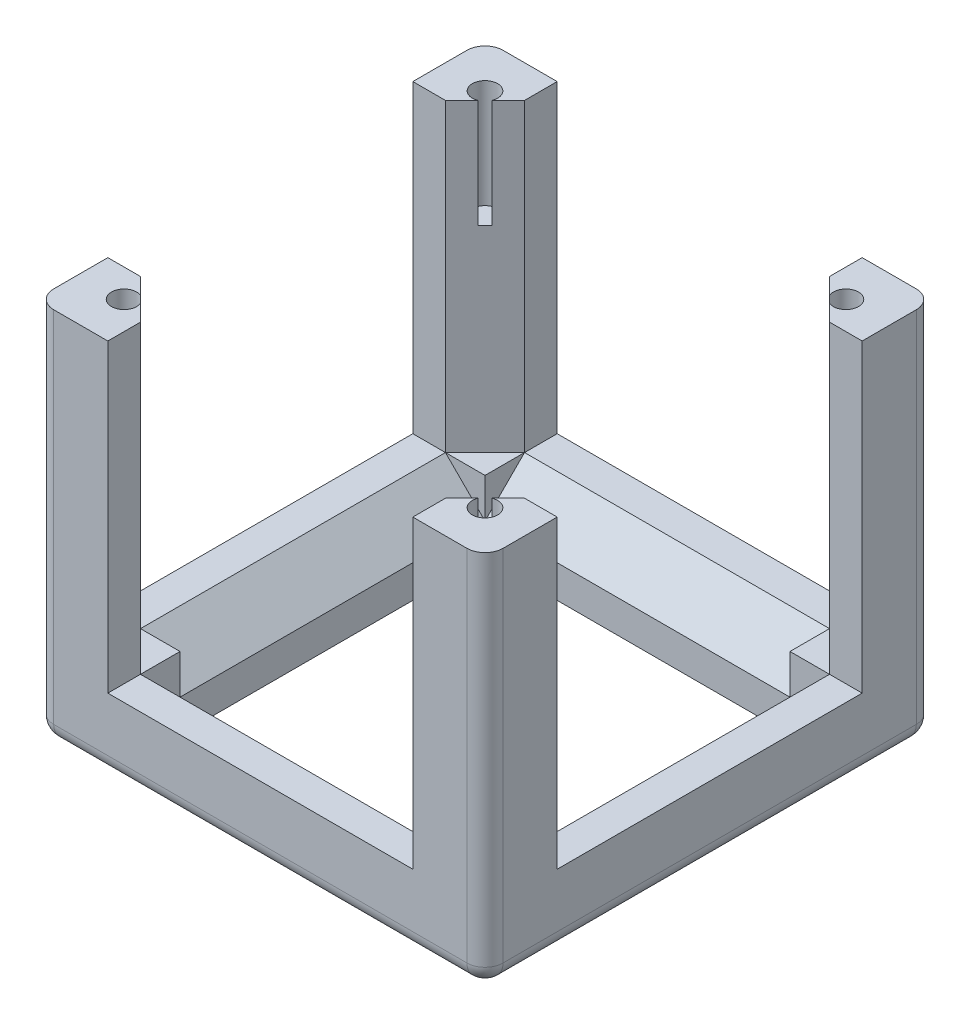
ISO-10303-21;
HEADER;
FILE_DESCRIPTION(('STEP AP214'),'2;1');
FILE_NAME('part.step','',(''),(''),'','','');
FILE_SCHEMA(('AUTOMOTIVE_DESIGN { 1 0 10303 214 1 1 1 1 }'));
ENDSEC;
DATA;
#1=APPLICATION_CONTEXT('core data for automotive mechanical design processes');
#2=APPLICATION_PROTOCOL_DEFINITION('international standard','automotive_design',2000,#1);
#3=PRODUCT_CONTEXT('',#1,'mechanical');
#4=PRODUCT('Part','Part','',(#3));
#5=PRODUCT_RELATED_PRODUCT_CATEGORY('part','',(#4));
#6=PRODUCT_DEFINITION_FORMATION('','',#4);
#7=PRODUCT_DEFINITION_CONTEXT('part definition',#1,'design');
#8=PRODUCT_DEFINITION('design','',#6,#7);
#9=PRODUCT_DEFINITION_SHAPE('','',#8);
#10=(LENGTH_UNIT() NAMED_UNIT(*) SI_UNIT(.MILLI.,.METRE.));
#11=(NAMED_UNIT(*) PLANE_ANGLE_UNIT() SI_UNIT($,.RADIAN.));
#12=(NAMED_UNIT(*) SI_UNIT($,.STERADIAN.) SOLID_ANGLE_UNIT());
#13=UNCERTAINTY_MEASURE_WITH_UNIT(LENGTH_MEASURE(1.E-05),#10,'distance_accuracy_value','');
#14=(GEOMETRIC_REPRESENTATION_CONTEXT(3) GLOBAL_UNCERTAINTY_ASSIGNED_CONTEXT((#13)) GLOBAL_UNIT_ASSIGNED_CONTEXT((#10,
#11,#12)) REPRESENTATION_CONTEXT('',''));
#15=CARTESIAN_POINT('',(0.,0.,0.));
#16=DIRECTION('',(0.,0.,1.));
#17=DIRECTION('',(1.,0.,0.));
#18=AXIS2_PLACEMENT_3D('',#15,#16,#17);
#19=CARTESIAN_POINT('',(0.,8.,0.));
#20=DIRECTION('',(0.,-1.,0.));
#21=DIRECTION('',(0.,0.,-1.));
#22=AXIS2_PLACEMENT_3D('',#19,#20,#21);
#23=PLANE('',#22);
#24=DIRECTION('',(0.,0.,1.));
#25=VECTOR('',#24,1.);
#26=CARTESIAN_POINT('',(-16.9,7.99999999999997,-21.2840620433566));
#27=LINE('',#26,#25);
#28=CARTESIAN_POINT('',(-16.9,7.99999999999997,-21.2840620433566));
#29=VERTEX_POINT('',#28);
#30=CARTESIAN_POINT('',(-16.9,7.99999999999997,-16.9));
#31=VERTEX_POINT('',#30);
#32=EDGE_CURVE('E873',#29,#31,#27,.T.);
#33=ORIENTED_EDGE('',*,*,#32,.F.);
#34=DIRECTION('',(-0.707106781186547,0.,0.707106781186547));
#35=VECTOR('',#34,1.);
#36=CARTESIAN_POINT('',(-16.9,8.,-21.2840620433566));
#37=LINE('',#36,#35);
#38=CARTESIAN_POINT('',(-21.2840620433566,8.,-16.9));
#39=VERTEX_POINT('',#38);
#40=EDGE_CURVE('E805',#29,#39,#37,.T.);
#41=ORIENTED_EDGE('',*,*,#40,.T.);
#42=DIRECTION('',(-1.,0.,0.));
#43=VECTOR('',#42,1.);
#44=CARTESIAN_POINT('',(0.,8.,-16.9));
#45=LINE('',#44,#43);
#46=EDGE_CURVE('E503',#31,#39,#45,.T.);
#47=ORIENTED_EDGE('',*,*,#46,.F.);
#48=EDGE_LOOP('',(#33,#41,#47));
#49=FACE_BOUND('',#48,.T.);
#50=ADVANCED_FACE('F69',(#49),#23,.F.);
#51=DIRECTION('',(-1.,0.,0.));
#52=VECTOR('',#51,1.);
#53=CARTESIAN_POINT('',(23.1,7.99999999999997,-21.2840620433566));
#54=LINE('',#53,#52);
#55=CARTESIAN_POINT('',(16.9,7.99999999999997,-21.2840620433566));
#56=VERTEX_POINT('',#55);
#57=EDGE_CURVE('E820',#56,#29,#54,.T.);
#58=ORIENTED_EDGE('',*,*,#57,.F.);
#59=DIRECTION('',(0.,0.,-1.));
#60=VECTOR('',#59,1.);
#61=CARTESIAN_POINT('',(16.9,8.,24.9));
#62=LINE('',#61,#60);
#63=CARTESIAN_POINT('',(16.9,7.99999999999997,-24.9));
#64=VERTEX_POINT('',#63);
#65=EDGE_CURVE('E406',#56,#64,#62,.T.);
#66=ORIENTED_EDGE('',*,*,#65,.T.);
#67=DIRECTION('',(-1.,0.,0.));
#68=VECTOR('',#67,1.);
#69=CARTESIAN_POINT('',(16.9,8.,-24.9));
#70=LINE('',#69,#68);
#71=CARTESIAN_POINT('',(-16.9,8.,-24.9));
#72=VERTEX_POINT('',#71);
#73=EDGE_CURVE('E429',#64,#72,#70,.T.);
#74=ORIENTED_EDGE('',*,*,#73,.T.);
#75=DIRECTION('',(0.,0.,-1.));
#76=VECTOR('',#75,1.);
#77=CARTESIAN_POINT('',(-16.9,8.,24.9));
#78=LINE('',#77,#76);
#79=EDGE_CURVE('E423',#29,#72,#78,.T.);
#80=ORIENTED_EDGE('',*,*,#79,.F.);
#81=EDGE_LOOP('',(#58,#66,#74,#80));
#82=FACE_BOUND('',#81,.T.);
#83=ADVANCED_FACE('F659',(#82),#23,.F.);
#84=DIRECTION('',(-1.,0.,0.));
#85=VECTOR('',#84,1.);
#86=CARTESIAN_POINT('',(23.1,7.99999999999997,21.2840620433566));
#87=LINE('',#86,#85);
#88=CARTESIAN_POINT('',(16.9,7.99999999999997,21.2840620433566));
#89=VERTEX_POINT('',#88);
#90=CARTESIAN_POINT('',(-16.9,7.99999999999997,21.2840620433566));
#91=VERTEX_POINT('',#90);
#92=EDGE_CURVE('E908',#89,#91,#87,.T.);
#93=ORIENTED_EDGE('',*,*,#92,.T.);
#94=CARTESIAN_POINT('',(-16.9,8.,24.9));
#95=VERTEX_POINT('',#94);
#96=EDGE_CURVE('E425',#95,#91,#78,.T.);
#97=ORIENTED_EDGE('',*,*,#96,.F.);
#98=DIRECTION('',(-1.,0.,0.));
#99=VECTOR('',#98,1.);
#100=CARTESIAN_POINT('',(16.9,8.,24.9));
#101=LINE('',#100,#99);
#102=CARTESIAN_POINT('',(16.9,8.,24.9));
#103=VERTEX_POINT('',#102);
#104=EDGE_CURVE('E419',#103,#95,#101,.T.);
#105=ORIENTED_EDGE('',*,*,#104,.F.);
#106=EDGE_CURVE('E414',#103,#89,#62,.T.);
#107=ORIENTED_EDGE('',*,*,#106,.T.);
#108=EDGE_LOOP('',(#93,#97,#105,#107));
#109=FACE_BOUND('',#108,.T.);
#110=ADVANCED_FACE('F666',(#109),#23,.F.);
#111=DIRECTION('',(0.707106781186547,0.,0.707106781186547));
#112=VECTOR('',#111,1.);
#113=CARTESIAN_POINT('',(-21.2840620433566,8.,16.9));
#114=LINE('',#113,#112);
#115=CARTESIAN_POINT('',(-21.2840620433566,8.,16.9));
#116=VERTEX_POINT('',#115);
#117=EDGE_CURVE('E744',#116,#91,#114,.T.);
#118=ORIENTED_EDGE('',*,*,#117,.T.);
#119=DIRECTION('',(0.,0.,1.));
#120=VECTOR('',#119,1.);
#121=CARTESIAN_POINT('',(-16.9,7.99999999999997,21.2840620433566));
#122=LINE('',#121,#120);
#123=CARTESIAN_POINT('',(-16.9,7.99999999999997,16.9));
#124=VERTEX_POINT('',#123);
#125=EDGE_CURVE('E746',#124,#91,#122,.T.);
#126=ORIENTED_EDGE('',*,*,#125,.F.);
#127=DIRECTION('',(-1.,0.,0.));
#128=VECTOR('',#127,1.);
#129=CARTESIAN_POINT('',(0.,8.,16.9));
#130=LINE('',#129,#128);
#131=EDGE_CURVE('E385',#124,#116,#130,.T.);
#132=ORIENTED_EDGE('',*,*,#131,.T.);
#133=EDGE_LOOP('',(#118,#126,#132));
#134=FACE_BOUND('',#133,.T.);
#135=ADVANCED_FACE('F682',(#134),#23,.F.);
#136=CARTESIAN_POINT('',(0.,0.,-16.9));
#137=DIRECTION('',(0.,0.,1.));
#138=DIRECTION('',(1.,0.,0.));
#139=AXIS2_PLACEMENT_3D('',#136,#137,#138);
#140=PLANE('',#139);
#141=DIRECTION('',(0.707106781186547,-0.707106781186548,0.));
#142=VECTOR('',#141,1.);
#143=CARTESIAN_POINT('',(-16.9,3.61593795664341,-16.9));
#144=LINE('',#143,#142);
#145=CARTESIAN_POINT('',(-16.9,3.61593795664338,-16.9));
#146=VERTEX_POINT('',#145);
#147=EDGE_CURVE('E763',#39,#146,#144,.T.);
#148=ORIENTED_EDGE('',*,*,#147,.T.);
#149=DIRECTION('',(0.,-1.,0.));
#150=VECTOR('',#149,1.);
#151=CARTESIAN_POINT('',(-16.9,7.99999999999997,-16.9));
#152=LINE('',#151,#150);
#153=EDGE_CURVE('E872',#31,#146,#152,.T.);
#154=ORIENTED_EDGE('',*,*,#153,.F.);
#155=ORIENTED_EDGE('',*,*,#46,.T.);
#156=EDGE_LOOP('',(#148,#154,#155));
#157=FACE_BOUND('',#156,.T.);
#158=ADVANCED_FACE('F871',(#157),#140,.T.);
#159=DIRECTION('',(0.,1.,0.));
#160=VECTOR('',#159,1.);
#161=CARTESIAN_POINT('',(16.9,0.,-16.9));
#162=LINE('',#161,#160);
#163=CARTESIAN_POINT('',(16.9,0.,-16.9));
#164=VERTEX_POINT('',#163);
#165=CARTESIAN_POINT('',(16.9,3.61593795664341,-16.9));
#166=VERTEX_POINT('',#165);
#167=EDGE_CURVE('E386',#164,#166,#162,.T.);
#168=ORIENTED_EDGE('',*,*,#167,.T.);
#169=DIRECTION('',(-1.,0.,0.));
#170=VECTOR('',#169,1.);
#171=CARTESIAN_POINT('',(23.1,3.61593795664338,-16.9));
#172=LINE('',#171,#170);
#173=EDGE_CURVE('E919',#166,#146,#172,.T.);
#174=ORIENTED_EDGE('',*,*,#173,.T.);
#175=DIRECTION('',(0.,1.,0.));
#176=VECTOR('',#175,1.);
#177=CARTESIAN_POINT('',(-16.9,0.,-16.9));
#178=LINE('',#177,#176);
#179=CARTESIAN_POINT('',(-16.9,0.,-16.9));
#180=VERTEX_POINT('',#179);
#181=EDGE_CURVE('E381',#180,#146,#178,.T.);
#182=ORIENTED_EDGE('',*,*,#181,.F.);
#183=DIRECTION('',(1.,0.,0.));
#184=VECTOR('',#183,1.);
#185=CARTESIAN_POINT('',(0.,0.,-16.9));
#186=LINE('',#185,#184);
#187=EDGE_CURVE('E377',#180,#164,#186,.T.);
#188=ORIENTED_EDGE('',*,*,#187,.T.);
#189=EDGE_LOOP('',(#168,#174,#182,#188));
#190=FACE_BOUND('',#189,.T.);
#191=ADVANCED_FACE('F1022',(#190),#140,.T.);
#192=CARTESIAN_POINT('',(0.,0.,16.9));
#193=DIRECTION('',(0.,0.,1.));
#194=DIRECTION('',(1.,0.,0.));
#195=AXIS2_PLACEMENT_3D('',#192,#193,#194);
#196=PLANE('',#195);
#197=DIRECTION('',(-1.,0.,0.));
#198=VECTOR('',#197,1.);
#199=CARTESIAN_POINT('',(23.1,3.61593795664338,16.9));
#200=LINE('',#199,#198);
#201=CARTESIAN_POINT('',(16.9,3.61593795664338,16.9));
#202=VERTEX_POINT('',#201);
#203=CARTESIAN_POINT('',(-16.9,3.61593795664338,16.9));
#204=VERTEX_POINT('',#203);
#205=EDGE_CURVE('E917',#202,#204,#200,.T.);
#206=ORIENTED_EDGE('',*,*,#205,.F.);
#207=DIRECTION('',(0.,1.,0.));
#208=VECTOR('',#207,1.);
#209=CARTESIAN_POINT('',(16.9,0.,16.9));
#210=LINE('',#209,#208);
#211=CARTESIAN_POINT('',(16.9,0.,16.9));
#212=VERTEX_POINT('',#211);
#213=EDGE_CURVE('E390',#212,#202,#210,.T.);
#214=ORIENTED_EDGE('',*,*,#213,.F.);
#215=DIRECTION('',(1.,0.,0.));
#216=VECTOR('',#215,1.);
#217=CARTESIAN_POINT('',(0.,0.,16.9));
#218=LINE('',#217,#216);
#219=CARTESIAN_POINT('',(-16.9,0.,16.9));
#220=VERTEX_POINT('',#219);
#221=EDGE_CURVE('E368',#220,#212,#218,.T.);
#222=ORIENTED_EDGE('',*,*,#221,.F.);
#223=DIRECTION('',(0.,1.,0.));
#224=VECTOR('',#223,1.);
#225=CARTESIAN_POINT('',(-16.9,0.,16.9));
#226=LINE('',#225,#224);
#227=EDGE_CURVE('E380',#220,#204,#226,.T.);
#228=ORIENTED_EDGE('',*,*,#227,.T.);
#229=EDGE_LOOP('',(#206,#214,#222,#228));
#230=FACE_BOUND('',#229,.T.);
#231=ADVANCED_FACE('F683',(#230),#196,.F.);
#232=ORIENTED_EDGE('',*,*,#131,.F.);
#233=DIRECTION('',(0.,1.,0.));
#234=VECTOR('',#233,1.);
#235=CARTESIAN_POINT('',(-16.9,7.99999999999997,16.9));
#236=LINE('',#235,#234);
#237=EDGE_CURVE('E751',#204,#124,#236,.T.);
#238=ORIENTED_EDGE('',*,*,#237,.F.);
#239=DIRECTION('',(0.707106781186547,-0.707106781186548,0.));
#240=VECTOR('',#239,1.);
#241=CARTESIAN_POINT('',(-16.9,3.61593795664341,16.9));
#242=LINE('',#241,#240);
#243=EDGE_CURVE('E749',#116,#204,#242,.T.);
#244=ORIENTED_EDGE('',*,*,#243,.F.);
#245=EDGE_LOOP('',(#232,#238,#244));
#246=FACE_BOUND('',#245,.T.);
#247=ADVANCED_FACE('F673',(#246),#196,.F.);
#248=DIRECTION('',(0.,0.,-1.));
#249=VECTOR('',#248,1.);
#250=CARTESIAN_POINT('',(-21.2840620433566,8.,23.1));
#251=LINE('',#250,#249);
#252=EDGE_CURVE('E760',#116,#39,#251,.T.);
#253=ORIENTED_EDGE('',*,*,#252,.T.);
#254=DIRECTION('',(1.,0.,0.));
#255=VECTOR('',#254,1.);
#256=CARTESIAN_POINT('',(-24.9,8.,-16.9));
#257=LINE('',#256,#255);
#258=CARTESIAN_POINT('',(-24.9,8.,-16.9));
#259=VERTEX_POINT('',#258);
#260=EDGE_CURVE('E465',#259,#39,#257,.T.);
#261=ORIENTED_EDGE('',*,*,#260,.F.);
#262=DIRECTION('',(0.,0.,-1.));
#263=VECTOR('',#262,1.);
#264=CARTESIAN_POINT('',(-24.9,8.,16.9));
#265=LINE('',#264,#263);
#266=CARTESIAN_POINT('',(-24.9,8.,16.9));
#267=VERTEX_POINT('',#266);
#268=EDGE_CURVE('E401',#267,#259,#265,.T.);
#269=ORIENTED_EDGE('',*,*,#268,.F.);
#270=DIRECTION('',(1.,0.,0.));
#271=VECTOR('',#270,1.);
#272=CARTESIAN_POINT('',(-24.9,8.,16.9));
#273=LINE('',#272,#271);
#274=EDGE_CURVE('E456',#267,#116,#273,.T.);
#275=ORIENTED_EDGE('',*,*,#274,.T.);
#276=EDGE_LOOP('',(#253,#261,#269,#275));
#277=FACE_BOUND('',#276,.T.);
#278=ADVANCED_FACE('F662',(#277),#23,.F.);
#279=DIRECTION('',(-0.707106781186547,0.,-0.707106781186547));
#280=VECTOR('',#279,1.);
#281=CARTESIAN_POINT('',(21.2840620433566,8.,-16.9));
#282=LINE('',#281,#280);
#283=CARTESIAN_POINT('',(21.2840620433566,8.,-16.9));
#284=VERTEX_POINT('',#283);
#285=EDGE_CURVE('E809',#284,#56,#282,.T.);
#286=ORIENTED_EDGE('',*,*,#285,.T.);
#287=DIRECTION('',(0.,0.,1.));
#288=VECTOR('',#287,1.);
#289=CARTESIAN_POINT('',(16.9,7.99999999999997,-21.2840620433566));
#290=LINE('',#289,#288);
#291=CARTESIAN_POINT('',(16.9,7.99999999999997,-16.9));
#292=VERTEX_POINT('',#291);
#293=EDGE_CURVE('E941',#56,#292,#290,.T.);
#294=ORIENTED_EDGE('',*,*,#293,.T.);
#295=EDGE_CURVE('E504',#284,#292,#45,.T.);
#296=ORIENTED_EDGE('',*,*,#295,.F.);
#297=EDGE_LOOP('',(#286,#294,#296));
#298=FACE_BOUND('',#297,.T.);
#299=ADVANCED_FACE('F672',(#298),#23,.F.);
#300=CARTESIAN_POINT('',(21.2840620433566,8.,16.9));
#301=VERTEX_POINT('',#300);
#302=CARTESIAN_POINT('',(16.9,8.,16.9));
#303=VERTEX_POINT('',#302);
#304=EDGE_CURVE('E397',#301,#303,#130,.T.);
#305=ORIENTED_EDGE('',*,*,#304,.T.);
#306=DIRECTION('',(0.,0.,1.));
#307=VECTOR('',#306,1.);
#308=CARTESIAN_POINT('',(16.9,7.99999999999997,21.2840620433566));
#309=LINE('',#308,#307);
#310=EDGE_CURVE('E728',#303,#89,#309,.T.);
#311=ORIENTED_EDGE('',*,*,#310,.T.);
#312=DIRECTION('',(0.707106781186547,0.,-0.707106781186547));
#313=VECTOR('',#312,1.);
#314=CARTESIAN_POINT('',(16.9,8.,21.2840620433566));
#315=LINE('',#314,#313);
#316=EDGE_CURVE('E719',#89,#301,#315,.T.);
#317=ORIENTED_EDGE('',*,*,#316,.T.);
#318=EDGE_LOOP('',(#305,#311,#317));
#319=FACE_BOUND('',#318,.T.);
#320=ADVANCED_FACE('F680',(#319),#23,.F.);
#321=DIRECTION('',(0.,0.,-1.));
#322=VECTOR('',#321,1.);
#323=CARTESIAN_POINT('',(21.2840620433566,8.,23.1));
#324=LINE('',#323,#322);
#325=EDGE_CURVE('E702',#301,#284,#324,.T.);
#326=ORIENTED_EDGE('',*,*,#325,.F.);
#327=CARTESIAN_POINT('',(24.9,7.99999999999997,16.9));
#328=VERTEX_POINT('',#327);
#329=EDGE_CURVE('E451',#301,#328,#273,.T.);
#330=ORIENTED_EDGE('',*,*,#329,.T.);
#331=DIRECTION('',(0.,0.,-1.));
#332=VECTOR('',#331,1.);
#333=CARTESIAN_POINT('',(24.9,8.,16.9));
#334=LINE('',#333,#332);
#335=CARTESIAN_POINT('',(24.9,8.,-16.9));
#336=VERTEX_POINT('',#335);
#337=EDGE_CURVE('E469',#328,#336,#334,.T.);
#338=ORIENTED_EDGE('',*,*,#337,.T.);
#339=EDGE_CURVE('E464',#284,#336,#257,.T.);
#340=ORIENTED_EDGE('',*,*,#339,.F.);
#341=EDGE_LOOP('',(#326,#330,#338,#340));
#342=FACE_BOUND('',#341,.T.);
#343=ADVANCED_FACE('F675',(#342),#23,.F.);
#344=CARTESIAN_POINT('',(-16.9,0.,0.));
#345=DIRECTION('',(1.,0.,0.));
#346=DIRECTION('',(0.,0.,-1.));
#347=AXIS2_PLACEMENT_3D('',#344,#345,#346);
#348=PLANE('',#347);
#349=ORIENTED_EDGE('',*,*,#181,.T.);
#350=DIRECTION('',(0.,0.,-1.));
#351=VECTOR('',#350,1.);
#352=CARTESIAN_POINT('',(-16.9,3.61593795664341,23.1));
#353=LINE('',#352,#351);
#354=EDGE_CURVE('E757',#204,#146,#353,.T.);
#355=ORIENTED_EDGE('',*,*,#354,.F.);
#356=ORIENTED_EDGE('',*,*,#227,.F.);
#357=DIRECTION('',(0.,0.,-1.));
#358=VECTOR('',#357,1.);
#359=CARTESIAN_POINT('',(-16.9,0.,0.));
#360=LINE('',#359,#358);
#361=EDGE_CURVE('E365',#220,#180,#360,.T.);
#362=ORIENTED_EDGE('',*,*,#361,.T.);
#363=EDGE_LOOP('',(#349,#355,#356,#362));
#364=FACE_BOUND('',#363,.T.);
#365=ADVANCED_FACE('F689',(#364),#348,.T.);
#366=CARTESIAN_POINT('',(16.9,0.,0.));
#367=DIRECTION('',(1.,0.,0.));
#368=DIRECTION('',(0.,0.,-1.));
#369=AXIS2_PLACEMENT_3D('',#366,#367,#368);
#370=PLANE('',#369);
#371=DIRECTION('',(0.,0.,-1.));
#372=VECTOR('',#371,1.);
#373=CARTESIAN_POINT('',(16.9,3.61593795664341,23.1));
#374=LINE('',#373,#372);
#375=EDGE_CURVE('E766',#202,#166,#374,.T.);
#376=ORIENTED_EDGE('',*,*,#375,.T.);
#377=ORIENTED_EDGE('',*,*,#167,.F.);
#378=DIRECTION('',(0.,0.,-1.));
#379=VECTOR('',#378,1.);
#380=CARTESIAN_POINT('',(16.9,0.,0.));
#381=LINE('',#380,#379);
#382=EDGE_CURVE('E373',#212,#164,#381,.T.);
#383=ORIENTED_EDGE('',*,*,#382,.F.);
#384=ORIENTED_EDGE('',*,*,#213,.T.);
#385=EDGE_LOOP('',(#376,#377,#383,#384));
#386=FACE_BOUND('',#385,.T.);
#387=ADVANCED_FACE('F695',(#386),#370,.F.);
#388=CARTESIAN_POINT('',(0.,41.8,0.));
#389=DIRECTION('',(0.,-1.,0.));
#390=DIRECTION('',(0.,0.,-1.));
#391=AXIS2_PLACEMENT_3D('',#388,#389,#390);
#392=PLANE('',#391);
#393=DIRECTION('',(0.707106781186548,0.,-0.707106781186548));
#394=VECTOR('',#393,1.);
#395=CARTESIAN_POINT('',(-16.9,41.8,-21.2840620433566));
#396=LINE('',#395,#394);
#397=CARTESIAN_POINT('',(-21.2840620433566,41.8,-16.9));
#398=VERTEX_POINT('',#397);
#399=CARTESIAN_POINT('',(-19.4864829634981,41.8,-18.6975790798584));
#400=VERTEX_POINT('',#399);
#401=EDGE_CURVE('E344',#398,#400,#396,.T.);
#402=ORIENTED_EDGE('',*,*,#401,.T.);
#403=CARTESIAN_POINT('',(-20.,41.8,-20.));
#404=DIRECTION('',(0.,1.,0.));
#405=DIRECTION('',(0.,0.,1.));
#406=AXIS2_PLACEMENT_3D('',#403,#404,#405);
#407=CIRCLE('',#406,1.4);
#408=CARTESIAN_POINT('',(-18.6975790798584,41.8,-19.4864829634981));
#409=VERTEX_POINT('',#408);
#410=EDGE_CURVE('E326',#409,#400,#407,.T.);
#411=ORIENTED_EDGE('',*,*,#410,.F.);
#412=CARTESIAN_POINT('',(-16.9,41.8,-21.2840620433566));
#413=VERTEX_POINT('',#412);
#414=EDGE_CURVE('E355',#409,#413,#396,.T.);
#415=ORIENTED_EDGE('',*,*,#414,.T.);
#416=DIRECTION('',(0.,0.,-1.));
#417=VECTOR('',#416,1.);
#418=CARTESIAN_POINT('',(-16.9,41.8,24.9));
#419=LINE('',#418,#417);
#420=CARTESIAN_POINT('',(-16.9,41.8,-24.9));
#421=VERTEX_POINT('',#420);
#422=EDGE_CURVE('E413',#413,#421,#419,.T.);
#423=ORIENTED_EDGE('',*,*,#422,.T.);
#424=DIRECTION('',(-1.,0.,0.));
#425=VECTOR('',#424,1.);
#426=CARTESIAN_POINT('',(24.9,41.8,-24.9));
#427=LINE('',#426,#425);
#428=CARTESIAN_POINT('',(-22.9,41.8,-24.9));
#429=VERTEX_POINT('',#428);
#430=EDGE_CURVE('E498',#421,#429,#427,.T.);
#431=ORIENTED_EDGE('',*,*,#430,.T.);
#432=CARTESIAN_POINT('',(-22.9,41.8,-22.9));
#433=DIRECTION('',(0.,-1.,0.));
#434=DIRECTION('',(0.,0.,-1.));
#435=AXIS2_PLACEMENT_3D('',#432,#433,#434);
#436=CIRCLE('',#435,2.);
#437=CARTESIAN_POINT('',(-24.9,41.8,-22.9));
#438=VERTEX_POINT('',#437);
#439=EDGE_CURVE('E564',#429,#438,#436,.F.);
#440=ORIENTED_EDGE('',*,*,#439,.T.);
#441=DIRECTION('',(0.,0.,1.));
#442=VECTOR('',#441,1.);
#443=CARTESIAN_POINT('',(-24.9,41.8,-24.9));
#444=LINE('',#443,#442);
#445=CARTESIAN_POINT('',(-24.9,41.8,-16.9));
#446=VERTEX_POINT('',#445);
#447=EDGE_CURVE('E486',#438,#446,#444,.T.);
#448=ORIENTED_EDGE('',*,*,#447,.T.);
#449=DIRECTION('',(1.,0.,0.));
#450=VECTOR('',#449,1.);
#451=CARTESIAN_POINT('',(-24.9,41.8,-16.9));
#452=LINE('',#451,#450);
#453=EDGE_CURVE('E352',#446,#398,#452,.T.);
#454=ORIENTED_EDGE('',*,*,#453,.T.);
#455=EDGE_LOOP('',(#402,#411,#415,#423,#431,#440,#448,#454));
#456=FACE_BOUND('',#455,.T.);
#457=ADVANCED_FACE('F350',(#456),#392,.F.);
#458=DIRECTION('',(-0.707106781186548,0.,-0.707106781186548));
#459=VECTOR('',#458,1.);
#460=CARTESIAN_POINT('',(-21.2840620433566,41.8,16.9));
#461=LINE('',#460,#459);
#462=CARTESIAN_POINT('',(-16.9,41.8,21.2840620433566));
#463=VERTEX_POINT('',#462);
#464=CARTESIAN_POINT('',(-18.6975790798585,41.8,19.4864829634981));
#465=VERTEX_POINT('',#464);
#466=EDGE_CURVE('E786',#463,#465,#461,.T.);
#467=ORIENTED_EDGE('',*,*,#466,.T.);
#468=CARTESIAN_POINT('',(-20.,41.8,20.));
#469=DIRECTION('',(0.,1.,0.));
#470=DIRECTION('',(0.,0.,1.));
#471=AXIS2_PLACEMENT_3D('',#468,#469,#470);
#472=CIRCLE('',#471,1.4);
#473=CARTESIAN_POINT('',(-19.4864829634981,41.8,18.6975790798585));
#474=VERTEX_POINT('',#473);
#475=EDGE_CURVE('E798',#474,#465,#472,.T.);
#476=ORIENTED_EDGE('',*,*,#475,.F.);
#477=CARTESIAN_POINT('',(-21.2840620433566,41.8,16.9));
#478=VERTEX_POINT('',#477);
#479=EDGE_CURVE('E756',#474,#478,#461,.T.);
#480=ORIENTED_EDGE('',*,*,#479,.T.);
#481=DIRECTION('',(1.,0.,0.));
#482=VECTOR('',#481,1.);
#483=CARTESIAN_POINT('',(-24.9,41.8,16.9));
#484=LINE('',#483,#482);
#485=CARTESIAN_POINT('',(-24.9,41.8,16.9));
#486=VERTEX_POINT('',#485);
#487=EDGE_CURVE('E447',#486,#478,#484,.T.);
#488=ORIENTED_EDGE('',*,*,#487,.F.);
#489=CARTESIAN_POINT('',(-24.9,41.8,22.9));
#490=VERTEX_POINT('',#489);
#491=EDGE_CURVE('E446',#486,#490,#444,.T.);
#492=ORIENTED_EDGE('',*,*,#491,.T.);
#493=CARTESIAN_POINT('',(-22.9,41.8,22.9));
#494=DIRECTION('',(0.,-1.,0.));
#495=DIRECTION('',(0.,0.,-1.));
#496=AXIS2_PLACEMENT_3D('',#493,#494,#495);
#497=CIRCLE('',#496,2.);
#498=CARTESIAN_POINT('',(-22.9,41.8,24.9));
#499=VERTEX_POINT('',#498);
#500=EDGE_CURVE('E539',#490,#499,#497,.F.);
#501=ORIENTED_EDGE('',*,*,#500,.T.);
#502=DIRECTION('',(1.,0.,0.));
#503=VECTOR('',#502,1.);
#504=CARTESIAN_POINT('',(24.9,41.8,24.9));
#505=LINE('',#504,#503);
#506=CARTESIAN_POINT('',(-16.9,41.8,24.9));
#507=VERTEX_POINT('',#506);
#508=EDGE_CURVE('E490',#499,#507,#505,.T.);
#509=ORIENTED_EDGE('',*,*,#508,.T.);
#510=EDGE_CURVE('E408',#507,#463,#419,.T.);
#511=ORIENTED_EDGE('',*,*,#510,.T.);
#512=EDGE_LOOP('',(#467,#476,#480,#488,#492,#501,#509,#511));
#513=FACE_BOUND('',#512,.T.);
#514=ADVANCED_FACE('F795',(#513),#392,.F.);
#515=DIRECTION('',(0.707106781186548,0.,0.707106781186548));
#516=VECTOR('',#515,1.);
#517=CARTESIAN_POINT('',(21.2840620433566,41.8,-16.9));
#518=LINE('',#517,#516);
#519=CARTESIAN_POINT('',(16.9,41.8,-21.2840620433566));
#520=VERTEX_POINT('',#519);
#521=CARTESIAN_POINT('',(18.6975790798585,41.8,-19.4864829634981));
#522=VERTEX_POINT('',#521);
#523=EDGE_CURVE('E964',#520,#522,#518,.T.);
#524=ORIENTED_EDGE('',*,*,#523,.T.);
#525=CARTESIAN_POINT('',(20.,41.8,-20.));
#526=DIRECTION('',(0.,1.,0.));
#527=DIRECTION('',(0.,0.,1.));
#528=AXIS2_PLACEMENT_3D('',#525,#526,#527);
#529=CIRCLE('',#528,1.4);
#530=CARTESIAN_POINT('',(19.4864829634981,41.8,-18.6975790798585));
#531=VERTEX_POINT('',#530);
#532=EDGE_CURVE('E988',#531,#522,#529,.T.);
#533=ORIENTED_EDGE('',*,*,#532,.F.);
#534=CARTESIAN_POINT('',(21.2840620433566,41.8,-16.9));
#535=VERTEX_POINT('',#534);
#536=EDGE_CURVE('E730',#531,#535,#518,.T.);
#537=ORIENTED_EDGE('',*,*,#536,.T.);
#538=CARTESIAN_POINT('',(24.9,41.8,-16.9));
#539=VERTEX_POINT('',#538);
#540=EDGE_CURVE('E455',#535,#539,#452,.T.);
#541=ORIENTED_EDGE('',*,*,#540,.T.);
#542=DIRECTION('',(0.,0.,-1.));
#543=VECTOR('',#542,1.);
#544=CARTESIAN_POINT('',(24.9,41.8,-24.9));
#545=LINE('',#544,#543);
#546=CARTESIAN_POINT('',(24.9,41.8,-22.9));
#547=VERTEX_POINT('',#546);
#548=EDGE_CURVE('E493',#539,#547,#545,.T.);
#549=ORIENTED_EDGE('',*,*,#548,.T.);
#550=CARTESIAN_POINT('',(22.9,41.8,-22.9));
#551=DIRECTION('',(0.,-1.,0.));
#552=DIRECTION('',(0.,0.,-1.));
#553=AXIS2_PLACEMENT_3D('',#550,#551,#552);
#554=CIRCLE('',#553,2.);
#555=CARTESIAN_POINT('',(22.9,41.8,-24.9));
#556=VERTEX_POINT('',#555);
#557=EDGE_CURVE('E567',#547,#556,#554,.F.);
#558=ORIENTED_EDGE('',*,*,#557,.T.);
#559=CARTESIAN_POINT('',(16.9,41.8,-24.9));
#560=VERTEX_POINT('',#559);
#561=EDGE_CURVE('E499',#556,#560,#427,.T.);
#562=ORIENTED_EDGE('',*,*,#561,.T.);
#563=DIRECTION('',(0.,0.,-1.));
#564=VECTOR('',#563,1.);
#565=CARTESIAN_POINT('',(16.9,41.8,24.9));
#566=LINE('',#565,#564);
#567=EDGE_CURVE('E407',#520,#560,#566,.T.);
#568=ORIENTED_EDGE('',*,*,#567,.F.);
#569=EDGE_LOOP('',(#524,#533,#537,#541,#549,#558,#562,#568));
#570=FACE_BOUND('',#569,.T.);
#571=ADVANCED_FACE('F831',(#570),#392,.F.);
#572=DIRECTION('',(-0.707106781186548,0.,0.707106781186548));
#573=VECTOR('',#572,1.);
#574=CARTESIAN_POINT('',(16.9,41.8,21.2840620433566));
#575=LINE('',#574,#573);
#576=CARTESIAN_POINT('',(21.2840620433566,41.8,16.9));
#577=VERTEX_POINT('',#576);
#578=CARTESIAN_POINT('',(19.4864829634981,41.8,18.6975790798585));
#579=VERTEX_POINT('',#578);
#580=EDGE_CURVE('E721',#577,#579,#575,.T.);
#581=ORIENTED_EDGE('',*,*,#580,.T.);
#582=CARTESIAN_POINT('',(20.,41.8,20.));
#583=DIRECTION('',(0.,1.,0.));
#584=DIRECTION('',(0.,0.,1.));
#585=AXIS2_PLACEMENT_3D('',#582,#583,#584);
#586=CIRCLE('',#585,1.4);
#587=CARTESIAN_POINT('',(18.6975790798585,41.8,19.4864829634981));
#588=VERTEX_POINT('',#587);
#589=EDGE_CURVE('E339',#588,#579,#586,.T.);
#590=ORIENTED_EDGE('',*,*,#589,.F.);
#591=CARTESIAN_POINT('',(16.9,41.8,21.2840620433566));
#592=VERTEX_POINT('',#591);
#593=EDGE_CURVE('E779',#588,#592,#575,.T.);
#594=ORIENTED_EDGE('',*,*,#593,.T.);
#595=CARTESIAN_POINT('',(16.9,41.8,24.9));
#596=VERTEX_POINT('',#595);
#597=EDGE_CURVE('E402',#596,#592,#566,.T.);
#598=ORIENTED_EDGE('',*,*,#597,.F.);
#599=CARTESIAN_POINT('',(22.9,41.8,24.9));
#600=VERTEX_POINT('',#599);
#601=EDGE_CURVE('E489',#596,#600,#505,.T.);
#602=ORIENTED_EDGE('',*,*,#601,.T.);
#603=CARTESIAN_POINT('',(22.9,41.8,22.9));
#604=DIRECTION('',(0.,-1.,0.));
#605=DIRECTION('',(0.,0.,-1.));
#606=AXIS2_PLACEMENT_3D('',#603,#604,#605);
#607=CIRCLE('',#606,2.);
#608=CARTESIAN_POINT('',(24.9,41.8,22.9));
#609=VERTEX_POINT('',#608);
#610=EDGE_CURVE('E527',#600,#609,#607,.F.);
#611=ORIENTED_EDGE('',*,*,#610,.T.);
#612=CARTESIAN_POINT('',(24.9,41.8,16.9));
#613=VERTEX_POINT('',#612);
#614=EDGE_CURVE('E494',#609,#613,#545,.T.);
#615=ORIENTED_EDGE('',*,*,#614,.T.);
#616=EDGE_CURVE('E452',#577,#613,#484,.T.);
#617=ORIENTED_EDGE('',*,*,#616,.F.);
#618=EDGE_LOOP('',(#581,#590,#594,#598,#602,#611,#615,#617));
#619=FACE_BOUND('',#618,.T.);
#620=ADVANCED_FACE('F983',(#619),#392,.F.);
#621=CARTESIAN_POINT('',(-16.9,-60.1870417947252,24.9));
#622=DIRECTION('',(1.,0.,0.));
#623=DIRECTION('',(0.,0.,-1.));
#624=AXIS2_PLACEMENT_3D('',#621,#622,#623);
#625=PLANE('',#624);
#626=ORIENTED_EDGE('',*,*,#422,.F.);
#627=DIRECTION('',(0.,-1.,0.));
#628=VECTOR('',#627,1.);
#629=CARTESIAN_POINT('',(-16.9,48.,-21.2840620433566));
#630=LINE('',#629,#628);
#631=EDGE_CURVE('E361',#413,#29,#630,.T.);
#632=ORIENTED_EDGE('',*,*,#631,.T.);
#633=ORIENTED_EDGE('',*,*,#79,.T.);
#634=DIRECTION('',(0.,1.,0.));
#635=VECTOR('',#634,1.);
#636=CARTESIAN_POINT('',(-16.9,-60.1870417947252,-24.9));
#637=LINE('',#636,#635);
#638=EDGE_CURVE('E433',#72,#421,#637,.T.);
#639=ORIENTED_EDGE('',*,*,#638,.T.);
#640=EDGE_LOOP('',(#626,#632,#633,#639));
#641=FACE_BOUND('',#640,.T.);
#642=ADVANCED_FACE('F818',(#641),#625,.T.);
#643=CARTESIAN_POINT('',(16.9,-60.1870417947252,24.9));
#644=DIRECTION('',(1.,0.,0.));
#645=DIRECTION('',(0.,0.,-1.));
#646=AXIS2_PLACEMENT_3D('',#643,#644,#645);
#647=PLANE('',#646);
#648=DIRECTION('',(0.,-1.,0.));
#649=VECTOR('',#648,1.);
#650=CARTESIAN_POINT('',(16.9,48.,-21.2840620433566));
#651=LINE('',#650,#649);
#652=EDGE_CURVE('E858',#520,#56,#651,.T.);
#653=ORIENTED_EDGE('',*,*,#652,.F.);
#654=ORIENTED_EDGE('',*,*,#567,.T.);
#655=DIRECTION('',(0.,1.,0.));
#656=VECTOR('',#655,1.);
#657=CARTESIAN_POINT('',(16.9,-60.1870417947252,-24.9));
#658=LINE('',#657,#656);
#659=EDGE_CURVE('E418',#64,#560,#658,.T.);
#660=ORIENTED_EDGE('',*,*,#659,.F.);
#661=ORIENTED_EDGE('',*,*,#65,.F.);
#662=EDGE_LOOP('',(#653,#654,#660,#661));
#663=FACE_BOUND('',#662,.T.);
#664=ADVANCED_FACE('F856',(#663),#647,.F.);
#665=CARTESIAN_POINT('',(-24.9,-60.1870417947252,-16.9));
#666=DIRECTION('',(0.,0.,1.));
#667=DIRECTION('',(1.,0.,0.));
#668=AXIS2_PLACEMENT_3D('',#665,#666,#667);
#669=PLANE('',#668);
#670=ORIENTED_EDGE('',*,*,#260,.T.);
#671=DIRECTION('',(0.,-1.,0.));
#672=VECTOR('',#671,1.);
#673=CARTESIAN_POINT('',(-21.2840620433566,48.,-16.9));
#674=LINE('',#673,#672);
#675=EDGE_CURVE('E808',#398,#39,#674,.T.);
#676=ORIENTED_EDGE('',*,*,#675,.F.);
#677=ORIENTED_EDGE('',*,*,#453,.F.);
#678=DIRECTION('',(0.,1.,0.));
#679=VECTOR('',#678,1.);
#680=CARTESIAN_POINT('',(-24.9,-60.1870417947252,-16.9));
#681=LINE('',#680,#679);
#682=EDGE_CURVE('E474',#259,#446,#681,.T.);
#683=ORIENTED_EDGE('',*,*,#682,.F.);
#684=EDGE_LOOP('',(#670,#676,#677,#683));
#685=FACE_BOUND('',#684,.T.);
#686=ADVANCED_FACE('F875',(#685),#669,.T.);
#687=CARTESIAN_POINT('',(-24.9,-60.1870417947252,16.9));
#688=DIRECTION('',(0.,0.,1.));
#689=DIRECTION('',(1.,0.,0.));
#690=AXIS2_PLACEMENT_3D('',#687,#688,#689);
#691=PLANE('',#690);
#692=DIRECTION('',(0.,-1.,0.));
#693=VECTOR('',#692,1.);
#694=CARTESIAN_POINT('',(-21.2840620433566,48.,16.9));
#695=LINE('',#694,#693);
#696=EDGE_CURVE('E775',#478,#116,#695,.T.);
#697=ORIENTED_EDGE('',*,*,#696,.T.);
#698=ORIENTED_EDGE('',*,*,#274,.F.);
#699=DIRECTION('',(0.,1.,0.));
#700=VECTOR('',#699,1.);
#701=CARTESIAN_POINT('',(-24.9,-60.1870417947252,16.9));
#702=LINE('',#701,#700);
#703=EDGE_CURVE('E424',#267,#486,#702,.T.);
#704=ORIENTED_EDGE('',*,*,#703,.T.);
#705=ORIENTED_EDGE('',*,*,#487,.T.);
#706=EDGE_LOOP('',(#697,#698,#704,#705));
#707=FACE_BOUND('',#706,.T.);
#708=ADVANCED_FACE('F782',(#707),#691,.F.);
#709=ORIENTED_EDGE('',*,*,#96,.T.);
#710=DIRECTION('',(0.,-1.,0.));
#711=VECTOR('',#710,1.);
#712=CARTESIAN_POINT('',(-16.9,48.,21.2840620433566));
#713=LINE('',#712,#711);
#714=EDGE_CURVE('E777',#463,#91,#713,.T.);
#715=ORIENTED_EDGE('',*,*,#714,.F.);
#716=ORIENTED_EDGE('',*,*,#510,.F.);
#717=DIRECTION('',(0.,1.,0.));
#718=VECTOR('',#717,1.);
#719=CARTESIAN_POINT('',(-16.9,-60.1870417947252,24.9));
#720=LINE('',#719,#718);
#721=EDGE_CURVE('E434',#95,#507,#720,.T.);
#722=ORIENTED_EDGE('',*,*,#721,.F.);
#723=EDGE_LOOP('',(#709,#715,#716,#722));
#724=FACE_BOUND('',#723,.T.);
#725=ADVANCED_FACE('F904',(#724),#625,.T.);
#726=DIRECTION('',(0.,-1.,0.));
#727=VECTOR('',#726,1.);
#728=CARTESIAN_POINT('',(16.9,48.,21.2840620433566));
#729=LINE('',#728,#727);
#730=EDGE_CURVE('E725',#592,#89,#729,.T.);
#731=ORIENTED_EDGE('',*,*,#730,.T.);
#732=ORIENTED_EDGE('',*,*,#106,.F.);
#733=DIRECTION('',(0.,1.,0.));
#734=VECTOR('',#733,1.);
#735=CARTESIAN_POINT('',(16.9,-60.1870417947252,24.9));
#736=LINE('',#735,#734);
#737=EDGE_CURVE('E412',#103,#596,#736,.T.);
#738=ORIENTED_EDGE('',*,*,#737,.T.);
#739=ORIENTED_EDGE('',*,*,#597,.T.);
#740=EDGE_LOOP('',(#731,#732,#738,#739));
#741=FACE_BOUND('',#740,.T.);
#742=ADVANCED_FACE('F979',(#741),#647,.F.);
#743=ORIENTED_EDGE('',*,*,#540,.F.);
#744=DIRECTION('',(0.,-1.,0.));
#745=VECTOR('',#744,1.);
#746=CARTESIAN_POINT('',(21.2840620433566,48.,-16.9));
#747=LINE('',#746,#745);
#748=EDGE_CURVE('E967',#535,#284,#747,.T.);
#749=ORIENTED_EDGE('',*,*,#748,.T.);
#750=ORIENTED_EDGE('',*,*,#339,.T.);
#751=DIRECTION('',(0.,1.,0.));
#752=VECTOR('',#751,1.);
#753=CARTESIAN_POINT('',(24.9,-60.1870417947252,-16.9));
#754=LINE('',#753,#752);
#755=EDGE_CURVE('E473',#336,#539,#754,.T.);
#756=ORIENTED_EDGE('',*,*,#755,.T.);
#757=EDGE_LOOP('',(#743,#749,#750,#756));
#758=FACE_BOUND('',#757,.T.);
#759=ADVANCED_FACE('F840',(#758),#669,.T.);
#760=DIRECTION('',(0.,-1.,0.));
#761=VECTOR('',#760,1.);
#762=CARTESIAN_POINT('',(21.2840620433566,48.,16.9));
#763=LINE('',#762,#761);
#764=EDGE_CURVE('E716',#577,#301,#763,.T.);
#765=ORIENTED_EDGE('',*,*,#764,.F.);
#766=ORIENTED_EDGE('',*,*,#616,.T.);
#767=DIRECTION('',(0.,1.,0.));
#768=VECTOR('',#767,1.);
#769=CARTESIAN_POINT('',(24.9,-60.1870417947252,16.9));
#770=LINE('',#769,#768);
#771=EDGE_CURVE('E460',#328,#613,#770,.T.);
#772=ORIENTED_EDGE('',*,*,#771,.F.);
#773=ORIENTED_EDGE('',*,*,#329,.F.);
#774=EDGE_LOOP('',(#765,#766,#772,#773));
#775=FACE_BOUND('',#774,.T.);
#776=ADVANCED_FACE('F732',(#775),#691,.F.);
#777=CARTESIAN_POINT('',(0.,0.,0.));
#778=DIRECTION('',(0.,-1.,0.));
#779=DIRECTION('',(0.,0.,-1.));
#780=AXIS2_PLACEMENT_3D('',#777,#778,#779);
#781=PLANE('',#780);
#782=DIRECTION('',(0.,0.,-1.));
#783=VECTOR('',#782,1.);
#784=CARTESIAN_POINT('',(22.9,0.,24.9));
#785=LINE('',#784,#783);
#786=CARTESIAN_POINT('',(22.9,0.,-22.9));
#787=VERTEX_POINT('',#786);
#788=CARTESIAN_POINT('',(22.9,0.,22.9));
#789=VERTEX_POINT('',#788);
#790=EDGE_CURVE('E545',#787,#789,#785,.F.);
#791=ORIENTED_EDGE('',*,*,#790,.T.);
#792=DIRECTION('',(1.,0.,0.));
#793=VECTOR('',#792,1.);
#794=CARTESIAN_POINT('',(-24.9,0.,22.9));
#795=LINE('',#794,#793);
#796=CARTESIAN_POINT('',(-22.9,0.,22.9));
#797=VERTEX_POINT('',#796);
#798=EDGE_CURVE('E551',#789,#797,#795,.F.);
#799=ORIENTED_EDGE('',*,*,#798,.T.);
#800=DIRECTION('',(0.,0.,1.));
#801=VECTOR('',#800,1.);
#802=CARTESIAN_POINT('',(-22.9,0.,-24.9));
#803=LINE('',#802,#801);
#804=CARTESIAN_POINT('',(-22.9,0.,-22.9));
#805=VERTEX_POINT('',#804);
#806=EDGE_CURVE('E548',#797,#805,#803,.F.);
#807=ORIENTED_EDGE('',*,*,#806,.T.);
#808=DIRECTION('',(-1.,0.,0.));
#809=VECTOR('',#808,1.);
#810=CARTESIAN_POINT('',(24.9,0.,-22.9));
#811=LINE('',#810,#809);
#812=EDGE_CURVE('E542',#805,#787,#811,.F.);
#813=ORIENTED_EDGE('',*,*,#812,.T.);
#814=EDGE_LOOP('',(#791,#799,#807,#813));
#815=FACE_BOUND('',#814,.T.);
#816=ORIENTED_EDGE('',*,*,#187,.F.);
#817=ORIENTED_EDGE('',*,*,#361,.F.);
#818=ORIENTED_EDGE('',*,*,#221,.T.);
#819=ORIENTED_EDGE('',*,*,#382,.T.);
#820=EDGE_LOOP('',(#816,#817,#818,#819));
#821=FACE_BOUND('',#820,.T.);
#822=ADVANCED_FACE('F1026',(#815,#821),#781,.T.);
#823=CARTESIAN_POINT('',(-24.9,41.8,-24.9));
#824=DIRECTION('',(1.,0.,0.));
#825=DIRECTION('',(0.,0.,-1.));
#826=AXIS2_PLACEMENT_3D('',#823,#824,#825);
#827=PLANE('',#826);
#828=DIRECTION('',(0.,0.,1.));
#829=VECTOR('',#828,1.);
#830=CARTESIAN_POINT('',(-24.9,2.,24.9));
#831=LINE('',#830,#829);
#832=CARTESIAN_POINT('',(-24.9,2.,-22.9));
#833=VERTEX_POINT('',#832);
#834=CARTESIAN_POINT('',(-24.9,2.,22.9));
#835=VERTEX_POINT('',#834);
#836=EDGE_CURVE('E533',#833,#835,#831,.T.);
#837=ORIENTED_EDGE('',*,*,#836,.T.);
#838=DIRECTION('',(0.,-1.,0.));
#839=VECTOR('',#838,1.);
#840=CARTESIAN_POINT('',(-24.9,41.8,22.9));
#841=LINE('',#840,#839);
#842=EDGE_CURVE('E536',#835,#490,#841,.F.);
#843=ORIENTED_EDGE('',*,*,#842,.T.);
#844=ORIENTED_EDGE('',*,*,#491,.F.);
#845=ORIENTED_EDGE('',*,*,#703,.F.);
#846=ORIENTED_EDGE('',*,*,#268,.T.);
#847=ORIENTED_EDGE('',*,*,#682,.T.);
#848=ORIENTED_EDGE('',*,*,#447,.F.);
#849=DIRECTION('',(0.,-1.,0.));
#850=VECTOR('',#849,1.);
#851=CARTESIAN_POINT('',(-24.9,41.8,-22.9));
#852=LINE('',#851,#850);
#853=EDGE_CURVE('E530',#438,#833,#852,.T.);
#854=ORIENTED_EDGE('',*,*,#853,.T.);
#855=EDGE_LOOP('',(#837,#843,#844,#845,#846,#847,#848,#854));
#856=FACE_BOUND('',#855,.T.);
#857=ADVANCED_FACE('F791',(#856),#827,.F.);
#858=CARTESIAN_POINT('',(24.9,41.8,24.9));
#859=DIRECTION('',(0.,0.,-1.));
#860=DIRECTION('',(-1.,0.,0.));
#861=AXIS2_PLACEMENT_3D('',#858,#859,#860);
#862=PLANE('',#861);
#863=DIRECTION('',(1.,0.,0.));
#864=VECTOR('',#863,1.);
#865=CARTESIAN_POINT('',(24.9,2.,24.9));
#866=LINE('',#865,#864);
#867=CARTESIAN_POINT('',(-22.9,2.,24.9));
#868=VERTEX_POINT('',#867);
#869=CARTESIAN_POINT('',(22.9,2.,24.9));
#870=VERTEX_POINT('',#869);
#871=EDGE_CURVE('E518',#868,#870,#866,.T.);
#872=ORIENTED_EDGE('',*,*,#871,.T.);
#873=DIRECTION('',(0.,-1.,0.));
#874=VECTOR('',#873,1.);
#875=CARTESIAN_POINT('',(22.9,41.8,24.9));
#876=LINE('',#875,#874);
#877=EDGE_CURVE('E524',#870,#600,#876,.F.);
#878=ORIENTED_EDGE('',*,*,#877,.T.);
#879=ORIENTED_EDGE('',*,*,#601,.F.);
#880=ORIENTED_EDGE('',*,*,#737,.F.);
#881=ORIENTED_EDGE('',*,*,#104,.T.);
#882=ORIENTED_EDGE('',*,*,#721,.T.);
#883=ORIENTED_EDGE('',*,*,#508,.F.);
#884=DIRECTION('',(0.,-1.,0.));
#885=VECTOR('',#884,1.);
#886=CARTESIAN_POINT('',(-22.9,41.8,24.9));
#887=LINE('',#886,#885);
#888=EDGE_CURVE('E521',#499,#868,#887,.T.);
#889=ORIENTED_EDGE('',*,*,#888,.T.);
#890=EDGE_LOOP('',(#872,#878,#879,#880,#881,#882,#883,#889));
#891=FACE_BOUND('',#890,.T.);
#892=ADVANCED_FACE('F899',(#891),#862,.F.);
#893=CARTESIAN_POINT('',(24.9,41.8,-24.9));
#894=DIRECTION('',(-1.,0.,0.));
#895=DIRECTION('',(0.,0.,1.));
#896=AXIS2_PLACEMENT_3D('',#893,#894,#895);
#897=PLANE('',#896);
#898=ORIENTED_EDGE('',*,*,#614,.F.);
#899=DIRECTION('',(0.,-1.,0.));
#900=VECTOR('',#899,1.);
#901=CARTESIAN_POINT('',(24.9,41.8,22.9));
#902=LINE('',#901,#900);
#903=CARTESIAN_POINT('',(24.9,2.,22.9));
#904=VERTEX_POINT('',#903);
#905=EDGE_CURVE('E514',#609,#904,#902,.T.);
#906=ORIENTED_EDGE('',*,*,#905,.T.);
#907=DIRECTION('',(0.,0.,-1.));
#908=VECTOR('',#907,1.);
#909=CARTESIAN_POINT('',(24.9,2.,-24.9));
#910=LINE('',#909,#908);
#911=CARTESIAN_POINT('',(24.9,2.,-22.9));
#912=VERTEX_POINT('',#911);
#913=EDGE_CURVE('E511',#904,#912,#910,.T.);
#914=ORIENTED_EDGE('',*,*,#913,.T.);
#915=DIRECTION('',(0.,-1.,0.));
#916=VECTOR('',#915,1.);
#917=CARTESIAN_POINT('',(24.9,41.8,-22.9));
#918=LINE('',#917,#916);
#919=EDGE_CURVE('E508',#912,#547,#918,.F.);
#920=ORIENTED_EDGE('',*,*,#919,.T.);
#921=ORIENTED_EDGE('',*,*,#548,.F.);
#922=ORIENTED_EDGE('',*,*,#755,.F.);
#923=ORIENTED_EDGE('',*,*,#337,.F.);
#924=ORIENTED_EDGE('',*,*,#771,.T.);
#925=EDGE_LOOP('',(#898,#906,#914,#920,#921,#922,#923,#924));
#926=FACE_BOUND('',#925,.T.);
#927=ADVANCED_FACE('F843',(#926),#897,.F.);
#928=CARTESIAN_POINT('',(24.9,41.8,-24.9));
#929=DIRECTION('',(0.,0.,1.));
#930=DIRECTION('',(1.,0.,0.));
#931=AXIS2_PLACEMENT_3D('',#928,#929,#930);
#932=PLANE('',#931);
#933=DIRECTION('',(-1.,0.,0.));
#934=VECTOR('',#933,1.);
#935=CARTESIAN_POINT('',(-24.9,2.,-24.9));
#936=LINE('',#935,#934);
#937=CARTESIAN_POINT('',(22.9,2.,-24.9));
#938=VERTEX_POINT('',#937);
#939=CARTESIAN_POINT('',(-22.9,2.,-24.9));
#940=VERTEX_POINT('',#939);
#941=EDGE_CURVE('E555',#938,#940,#936,.T.);
#942=ORIENTED_EDGE('',*,*,#941,.T.);
#943=DIRECTION('',(0.,-1.,0.));
#944=VECTOR('',#943,1.);
#945=CARTESIAN_POINT('',(-22.9,41.8,-24.9));
#946=LINE('',#945,#944);
#947=EDGE_CURVE('E561',#940,#429,#946,.F.);
#948=ORIENTED_EDGE('',*,*,#947,.T.);
#949=ORIENTED_EDGE('',*,*,#430,.F.);
#950=ORIENTED_EDGE('',*,*,#638,.F.);
#951=ORIENTED_EDGE('',*,*,#73,.F.);
#952=ORIENTED_EDGE('',*,*,#659,.T.);
#953=ORIENTED_EDGE('',*,*,#561,.F.);
#954=DIRECTION('',(0.,-1.,0.));
#955=VECTOR('',#954,1.);
#956=CARTESIAN_POINT('',(22.9,41.8,-24.9));
#957=LINE('',#956,#955);
#958=EDGE_CURVE('E558',#556,#938,#957,.T.);
#959=ORIENTED_EDGE('',*,*,#958,.T.);
#960=EDGE_LOOP('',(#942,#948,#949,#950,#951,#952,#953,#959));
#961=FACE_BOUND('',#960,.T.);
#962=ADVANCED_FACE('F862',(#961),#932,.F.);
#963=DIRECTION('',(0.,-1.,0.));
#964=VECTOR('',#963,1.);
#965=CARTESIAN_POINT('',(16.9,7.99999999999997,-16.9));
#966=LINE('',#965,#964);
#967=EDGE_CURVE('E933',#292,#166,#966,.T.);
#968=ORIENTED_EDGE('',*,*,#967,.T.);
#969=DIRECTION('',(0.707106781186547,0.707106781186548,0.));
#970=VECTOR('',#969,1.);
#971=CARTESIAN_POINT('',(16.9,3.61593795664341,-16.9));
#972=LINE('',#971,#970);
#973=EDGE_CURVE('E711',#166,#284,#972,.T.);
#974=ORIENTED_EDGE('',*,*,#973,.T.);
#975=ORIENTED_EDGE('',*,*,#295,.T.);
#976=EDGE_LOOP('',(#968,#974,#975));
#977=FACE_BOUND('',#976,.T.);
#978=ADVANCED_FACE('F1031',(#977),#140,.T.);
#979=DIRECTION('',(0.707106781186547,0.707106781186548,0.));
#980=VECTOR('',#979,1.);
#981=CARTESIAN_POINT('',(16.9,3.61593795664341,16.9));
#982=LINE('',#981,#980);
#983=EDGE_CURVE('E712',#202,#301,#982,.T.);
#984=ORIENTED_EDGE('',*,*,#983,.F.);
#985=DIRECTION('',(0.,1.,0.));
#986=VECTOR('',#985,1.);
#987=CARTESIAN_POINT('',(16.9,7.99999999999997,16.9));
#988=LINE('',#987,#986);
#989=EDGE_CURVE('E923',#202,#303,#988,.T.);
#990=ORIENTED_EDGE('',*,*,#989,.T.);
#991=ORIENTED_EDGE('',*,*,#304,.F.);
#992=EDGE_LOOP('',(#984,#990,#991));
#993=FACE_BOUND('',#992,.T.);
#994=ADVANCED_FACE('F686',(#993),#196,.F.);
#995=CARTESIAN_POINT('',(-22.9,41.8,-22.9));
#996=DIRECTION('',(0.,-1.,0.));
#997=DIRECTION('',(0.,0.,-1.));
#998=AXIS2_PLACEMENT_3D('',#995,#996,#997);
#999=CYLINDRICAL_SURFACE('',#998,2.);
#1000=CARTESIAN_POINT('',(-22.9,2.,-22.9));
#1001=DIRECTION('',(0.,-1.,0.));
#1002=DIRECTION('',(0.,0.,-1.));
#1003=AXIS2_PLACEMENT_3D('',#1000,#1001,#1002);
#1004=CIRCLE('',#1003,2.);
#1005=EDGE_CURVE('E369',#833,#940,#1004,.T.);
#1006=ORIENTED_EDGE('',*,*,#1005,.F.);
#1007=ORIENTED_EDGE('',*,*,#853,.F.);
#1008=ORIENTED_EDGE('',*,*,#439,.F.);
#1009=ORIENTED_EDGE('',*,*,#947,.F.);
#1010=EDGE_LOOP('',(#1006,#1007,#1008,#1009));
#1011=FACE_BOUND('',#1010,.T.);
#1012=ADVANCED_FACE('F71',(#1011),#999,.T.);
#1013=CARTESIAN_POINT('',(-22.9,2.,-22.9));
#1014=DIRECTION('',(0.,0.,-1.));
#1015=DIRECTION('',(0.,1.,0.));
#1016=AXIS2_PLACEMENT_3D('',#1013,#1014,#1015);
#1017=SPHERICAL_SURFACE('',#1016,2.);
#1018=CARTESIAN_POINT('',(-22.9,2.,-22.9));
#1019=DIRECTION('',(0.,0.,-1.));
#1020=DIRECTION('',(-1.,0.,0.));
#1021=AXIS2_PLACEMENT_3D('',#1018,#1019,#1020);
#1022=CIRCLE('',#1021,2.);
#1023=EDGE_CURVE('E600',#833,#805,#1022,.F.);
#1024=ORIENTED_EDGE('',*,*,#1023,.F.);
#1025=ORIENTED_EDGE('',*,*,#1005,.T.);
#1026=CARTESIAN_POINT('',(-22.9,2.,-22.9));
#1027=DIRECTION('',(-1.,0.,0.));
#1028=DIRECTION('',(0.,0.,1.));
#1029=AXIS2_PLACEMENT_3D('',#1026,#1027,#1028);
#1030=CIRCLE('',#1029,2.);
#1031=EDGE_CURVE('E604',#805,#940,#1030,.F.);
#1032=ORIENTED_EDGE('',*,*,#1031,.F.);
#1033=EDGE_LOOP('',(#1024,#1025,#1032));
#1034=FACE_BOUND('',#1033,.T.);
#1035=ADVANCED_FACE('F884',(#1034),#1017,.T.);
#1036=CARTESIAN_POINT('',(22.9,41.8,-22.9));
#1037=DIRECTION('',(0.,-1.,0.));
#1038=DIRECTION('',(0.,0.,-1.));
#1039=AXIS2_PLACEMENT_3D('',#1036,#1037,#1038);
#1040=CYLINDRICAL_SURFACE('',#1039,2.);
#1041=ORIENTED_EDGE('',*,*,#557,.F.);
#1042=ORIENTED_EDGE('',*,*,#919,.F.);
#1043=CARTESIAN_POINT('',(22.9,2.,-22.9));
#1044=DIRECTION('',(0.,-1.,0.));
#1045=DIRECTION('',(0.,0.,-1.));
#1046=AXIS2_PLACEMENT_3D('',#1043,#1044,#1045);
#1047=CIRCLE('',#1046,2.);
#1048=EDGE_CURVE('E596',#938,#912,#1047,.T.);
#1049=ORIENTED_EDGE('',*,*,#1048,.F.);
#1050=ORIENTED_EDGE('',*,*,#958,.F.);
#1051=EDGE_LOOP('',(#1041,#1042,#1049,#1050));
#1052=FACE_BOUND('',#1051,.T.);
#1053=ADVANCED_FACE('F1133',(#1052),#1040,.T.);
#1054=CARTESIAN_POINT('',(24.9,2.,-22.9));
#1055=DIRECTION('',(1.,0.,0.));
#1056=DIRECTION('',(0.,0.,-1.));
#1057=AXIS2_PLACEMENT_3D('',#1054,#1055,#1056);
#1058=CYLINDRICAL_SURFACE('',#1057,2.);
#1059=ORIENTED_EDGE('',*,*,#1031,.T.);
#1060=ORIENTED_EDGE('',*,*,#941,.F.);
#1061=CARTESIAN_POINT('',(22.9,2.,-22.9));
#1062=DIRECTION('',(1.,0.,0.));
#1063=DIRECTION('',(0.,0.,-1.));
#1064=AXIS2_PLACEMENT_3D('',#1061,#1062,#1063);
#1065=CIRCLE('',#1064,2.);
#1066=EDGE_CURVE('E592',#787,#938,#1065,.T.);
#1067=ORIENTED_EDGE('',*,*,#1066,.F.);
#1068=ORIENTED_EDGE('',*,*,#812,.F.);
#1069=EDGE_LOOP('',(#1059,#1060,#1067,#1068));
#1070=FACE_BOUND('',#1069,.T.);
#1071=ADVANCED_FACE('F1130',(#1070),#1058,.T.);
#1072=CARTESIAN_POINT('',(-22.9,2.,-24.9));
#1073=DIRECTION('',(0.,0.,-1.));
#1074=DIRECTION('',(-1.,0.,0.));
#1075=AXIS2_PLACEMENT_3D('',#1072,#1073,#1074);
#1076=CYLINDRICAL_SURFACE('',#1075,2.);
#1077=ORIENTED_EDGE('',*,*,#1023,.T.);
#1078=ORIENTED_EDGE('',*,*,#806,.F.);
#1079=CARTESIAN_POINT('',(-22.9,2.,22.9));
#1080=DIRECTION('',(0.,0.,1.));
#1081=DIRECTION('',(1.,0.,0.));
#1082=AXIS2_PLACEMENT_3D('',#1079,#1080,#1081);
#1083=CIRCLE('',#1082,2.);
#1084=EDGE_CURVE('E588',#835,#797,#1083,.T.);
#1085=ORIENTED_EDGE('',*,*,#1084,.F.);
#1086=ORIENTED_EDGE('',*,*,#836,.F.);
#1087=EDGE_LOOP('',(#1077,#1078,#1085,#1086));
#1088=FACE_BOUND('',#1087,.T.);
#1089=ADVANCED_FACE('F889',(#1088),#1076,.T.);
#1090=CARTESIAN_POINT('',(-22.9,41.8,22.9));
#1091=DIRECTION('',(0.,-1.,0.));
#1092=DIRECTION('',(0.,0.,-1.));
#1093=AXIS2_PLACEMENT_3D('',#1090,#1091,#1092);
#1094=CYLINDRICAL_SURFACE('',#1093,2.);
#1095=ORIENTED_EDGE('',*,*,#500,.F.);
#1096=ORIENTED_EDGE('',*,*,#842,.F.);
#1097=CARTESIAN_POINT('',(-22.9,2.,22.9));
#1098=DIRECTION('',(0.,-1.,0.));
#1099=DIRECTION('',(0.,0.,-1.));
#1100=AXIS2_PLACEMENT_3D('',#1097,#1098,#1099);
#1101=CIRCLE('',#1100,2.);
#1102=EDGE_CURVE('E584',#868,#835,#1101,.T.);
#1103=ORIENTED_EDGE('',*,*,#1102,.F.);
#1104=ORIENTED_EDGE('',*,*,#888,.F.);
#1105=EDGE_LOOP('',(#1095,#1096,#1103,#1104));
#1106=FACE_BOUND('',#1105,.T.);
#1107=ADVANCED_FACE('F893',(#1106),#1094,.T.);
#1108=CARTESIAN_POINT('',(22.9,2.,-22.9));
#1109=DIRECTION('',(0.,0.,-1.));
#1110=DIRECTION('',(0.,1.,0.));
#1111=AXIS2_PLACEMENT_3D('',#1108,#1109,#1110);
#1112=SPHERICAL_SURFACE('',#1111,2.);
#1113=ORIENTED_EDGE('',*,*,#1066,.T.);
#1114=ORIENTED_EDGE('',*,*,#1048,.T.);
#1115=CARTESIAN_POINT('',(22.9,2.,-22.9));
#1116=DIRECTION('',(0.,0.,-1.));
#1117=DIRECTION('',(-1.,0.,0.));
#1118=AXIS2_PLACEMENT_3D('',#1115,#1116,#1117);
#1119=CIRCLE('',#1118,2.);
#1120=EDGE_CURVE('E580',#787,#912,#1119,.F.);
#1121=ORIENTED_EDGE('',*,*,#1120,.F.);
#1122=EDGE_LOOP('',(#1113,#1114,#1121));
#1123=FACE_BOUND('',#1122,.T.);
#1124=ADVANCED_FACE('F1121',(#1123),#1112,.T.);
#1125=CARTESIAN_POINT('',(-22.9,2.,22.9));
#1126=DIRECTION('',(-1.,0.,0.));
#1127=DIRECTION('',(0.,-1.,0.));
#1128=AXIS2_PLACEMENT_3D('',#1125,#1126,#1127);
#1129=SPHERICAL_SURFACE('',#1128,2.);
#1130=ORIENTED_EDGE('',*,*,#1102,.T.);
#1131=ORIENTED_EDGE('',*,*,#1084,.T.);
#1132=CARTESIAN_POINT('',(-22.9,2.,22.9));
#1133=DIRECTION('',(-1.,0.,0.));
#1134=DIRECTION('',(0.,0.,1.));
#1135=AXIS2_PLACEMENT_3D('',#1132,#1133,#1134);
#1136=CIRCLE('',#1135,2.);
#1137=EDGE_CURVE('E577',#868,#797,#1136,.F.);
#1138=ORIENTED_EDGE('',*,*,#1137,.F.);
#1139=EDGE_LOOP('',(#1130,#1131,#1138));
#1140=FACE_BOUND('',#1139,.T.);
#1141=ADVANCED_FACE('F1117',(#1140),#1129,.T.);
#1142=CARTESIAN_POINT('',(22.9,2.,-24.9));
#1143=DIRECTION('',(0.,0.,1.));
#1144=DIRECTION('',(1.,0.,0.));
#1145=AXIS2_PLACEMENT_3D('',#1142,#1143,#1144);
#1146=CYLINDRICAL_SURFACE('',#1145,2.);
#1147=ORIENTED_EDGE('',*,*,#1120,.T.);
#1148=ORIENTED_EDGE('',*,*,#913,.F.);
#1149=CARTESIAN_POINT('',(22.9,2.,22.9));
#1150=DIRECTION('',(0.,0.,1.));
#1151=DIRECTION('',(1.,0.,0.));
#1152=AXIS2_PLACEMENT_3D('',#1149,#1150,#1151);
#1153=CIRCLE('',#1152,2.);
#1154=EDGE_CURVE('E573',#789,#904,#1153,.T.);
#1155=ORIENTED_EDGE('',*,*,#1154,.F.);
#1156=ORIENTED_EDGE('',*,*,#790,.F.);
#1157=EDGE_LOOP('',(#1147,#1148,#1155,#1156));
#1158=FACE_BOUND('',#1157,.T.);
#1159=ADVANCED_FACE('F1113',(#1158),#1146,.T.);
#1160=CARTESIAN_POINT('',(24.9,2.,22.9));
#1161=DIRECTION('',(-1.,0.,0.));
#1162=DIRECTION('',(0.,0.,1.));
#1163=AXIS2_PLACEMENT_3D('',#1160,#1161,#1162);
#1164=CYLINDRICAL_SURFACE('',#1163,2.);
#1165=ORIENTED_EDGE('',*,*,#1137,.T.);
#1166=ORIENTED_EDGE('',*,*,#798,.F.);
#1167=CARTESIAN_POINT('',(22.9,2.,22.9));
#1168=DIRECTION('',(1.,0.,0.));
#1169=DIRECTION('',(0.,0.,-1.));
#1170=AXIS2_PLACEMENT_3D('',#1167,#1168,#1169);
#1171=CIRCLE('',#1170,2.);
#1172=EDGE_CURVE('E359',#870,#789,#1171,.T.);
#1173=ORIENTED_EDGE('',*,*,#1172,.F.);
#1174=ORIENTED_EDGE('',*,*,#871,.F.);
#1175=EDGE_LOOP('',(#1165,#1166,#1173,#1174));
#1176=FACE_BOUND('',#1175,.T.);
#1177=ADVANCED_FACE('F1109',(#1176),#1164,.T.);
#1178=CARTESIAN_POINT('',(22.9,2.,22.9));
#1179=DIRECTION('',(0.,-1.,0.));
#1180=DIRECTION('',(0.,0.,-1.));
#1181=AXIS2_PLACEMENT_3D('',#1178,#1179,#1180);
#1182=SPHERICAL_SURFACE('',#1181,2.);
#1183=ORIENTED_EDGE('',*,*,#1172,.T.);
#1184=ORIENTED_EDGE('',*,*,#1154,.T.);
#1185=CARTESIAN_POINT('',(22.9,2.,22.9));
#1186=DIRECTION('',(0.,-1.,0.));
#1187=DIRECTION('',(0.,0.,-1.));
#1188=AXIS2_PLACEMENT_3D('',#1185,#1186,#1187);
#1189=CIRCLE('',#1188,2.);
#1190=EDGE_CURVE('E354',#870,#904,#1189,.F.);
#1191=ORIENTED_EDGE('',*,*,#1190,.F.);
#1192=EDGE_LOOP('',(#1183,#1184,#1191));
#1193=FACE_BOUND('',#1192,.T.);
#1194=ADVANCED_FACE('F1105',(#1193),#1182,.T.);
#1195=CARTESIAN_POINT('',(22.9,41.8,22.9));
#1196=DIRECTION('',(0.,-1.,0.));
#1197=DIRECTION('',(0.,0.,-1.));
#1198=AXIS2_PLACEMENT_3D('',#1195,#1196,#1197);
#1199=CYLINDRICAL_SURFACE('',#1198,2.);
#1200=ORIENTED_EDGE('',*,*,#610,.F.);
#1201=ORIENTED_EDGE('',*,*,#877,.F.);
#1202=ORIENTED_EDGE('',*,*,#1190,.T.);
#1203=ORIENTED_EDGE('',*,*,#905,.F.);
#1204=EDGE_LOOP('',(#1200,#1201,#1202,#1203));
#1205=FACE_BOUND('',#1204,.T.);
#1206=ADVANCED_FACE('F1059',(#1205),#1199,.T.);
#1207=CARTESIAN_POINT('',(16.9,48.,21.2840620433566));
#1208=DIRECTION('',(-0.707106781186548,0.,-0.707106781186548));
#1209=DIRECTION('',(-0.707106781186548,0.,0.707106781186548));
#1210=AXIS2_PLACEMENT_3D('',#1207,#1208,#1209);
#1211=PLANE('',#1210);
#1212=DIRECTION('',(0.,1.,0.));
#1213=VECTOR('',#1212,1.);
#1214=CARTESIAN_POINT('',(18.6975790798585,29.8,19.4864829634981));
#1215=LINE('',#1214,#1213);
#1216=CARTESIAN_POINT('',(18.6975790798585,29.8,19.4864829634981));
#1217=VERTEX_POINT('',#1216);
#1218=EDGE_CURVE('E13',#1217,#588,#1215,.T.);
#1219=ORIENTED_EDGE('',*,*,#1218,.F.);
#1220=DIRECTION('',(0.707106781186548,0.,-0.707106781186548));
#1221=VECTOR('',#1220,1.);
#1222=CARTESIAN_POINT('',(16.9,29.8,21.2840620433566));
#1223=LINE('',#1222,#1221);
#1224=CARTESIAN_POINT('',(19.4864829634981,29.8,18.6975790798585));
#1225=VERTEX_POINT('',#1224);
#1226=EDGE_CURVE('E636',#1217,#1225,#1223,.T.);
#1227=ORIENTED_EDGE('',*,*,#1226,.T.);
#1228=DIRECTION('',(0.,1.,0.));
#1229=VECTOR('',#1228,1.);
#1230=CARTESIAN_POINT('',(19.4864829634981,29.8,18.6975790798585));
#1231=LINE('',#1230,#1229);
#1232=EDGE_CURVE('E78',#579,#1225,#1231,.F.);
#1233=ORIENTED_EDGE('',*,*,#1232,.F.);
#1234=ORIENTED_EDGE('',*,*,#580,.F.);
#1235=ORIENTED_EDGE('',*,*,#764,.T.);
#1236=ORIENTED_EDGE('',*,*,#316,.F.);
#1237=ORIENTED_EDGE('',*,*,#730,.F.);
#1238=ORIENTED_EDGE('',*,*,#593,.F.);
#1239=EDGE_LOOP('',(#1219,#1227,#1233,#1234,#1235,#1236,#1237,#1238));
#1240=FACE_BOUND('',#1239,.T.);
#1241=ADVANCED_FACE('F647',(#1240),#1211,.T.);
#1242=CARTESIAN_POINT('',(21.2840620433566,48.,-16.9));
#1243=DIRECTION('',(-0.707106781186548,0.,0.707106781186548));
#1244=DIRECTION('',(0.707106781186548,0.,0.707106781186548));
#1245=AXIS2_PLACEMENT_3D('',#1242,#1243,#1244);
#1246=PLANE('',#1245);
#1247=DIRECTION('',(0.,1.,0.));
#1248=VECTOR('',#1247,1.);
#1249=CARTESIAN_POINT('',(19.4864829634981,29.8,-18.6975790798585));
#1250=LINE('',#1249,#1248);
#1251=CARTESIAN_POINT('',(19.4864829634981,29.8,-18.6975790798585));
#1252=VERTEX_POINT('',#1251);
#1253=EDGE_CURVE('E633',#1252,#531,#1250,.T.);
#1254=ORIENTED_EDGE('',*,*,#1253,.F.);
#1255=DIRECTION('',(-0.707106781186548,0.,-0.707106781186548));
#1256=VECTOR('',#1255,1.);
#1257=CARTESIAN_POINT('',(21.2840620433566,29.8,-16.9));
#1258=LINE('',#1257,#1256);
#1259=CARTESIAN_POINT('',(18.6975790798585,29.8,-19.4864829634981));
#1260=VERTEX_POINT('',#1259);
#1261=EDGE_CURVE('E626',#1252,#1260,#1258,.T.);
#1262=ORIENTED_EDGE('',*,*,#1261,.T.);
#1263=DIRECTION('',(0.,1.,0.));
#1264=VECTOR('',#1263,1.);
#1265=CARTESIAN_POINT('',(18.6975790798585,29.8,-19.4864829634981));
#1266=LINE('',#1265,#1264);
#1267=EDGE_CURVE('E630',#522,#1260,#1266,.F.);
#1268=ORIENTED_EDGE('',*,*,#1267,.F.);
#1269=ORIENTED_EDGE('',*,*,#523,.F.);
#1270=ORIENTED_EDGE('',*,*,#652,.T.);
#1271=ORIENTED_EDGE('',*,*,#285,.F.);
#1272=ORIENTED_EDGE('',*,*,#748,.F.);
#1273=ORIENTED_EDGE('',*,*,#536,.F.);
#1274=EDGE_LOOP('',(#1254,#1262,#1268,#1269,#1270,#1271,#1272,#1273));
#1275=FACE_BOUND('',#1274,.T.);
#1276=ADVANCED_FACE('F1034',(#1275),#1246,.T.);
#1277=CARTESIAN_POINT('',(-21.2840620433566,48.,16.9));
#1278=DIRECTION('',(0.707106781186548,0.,-0.707106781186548));
#1279=DIRECTION('',(-0.707106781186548,0.,-0.707106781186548));
#1280=AXIS2_PLACEMENT_3D('',#1277,#1278,#1279);
#1281=PLANE('',#1280);
#1282=DIRECTION('',(0.,1.,0.));
#1283=VECTOR('',#1282,1.);
#1284=CARTESIAN_POINT('',(-19.4864829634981,29.8,18.6975790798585));
#1285=LINE('',#1284,#1283);
#1286=CARTESIAN_POINT('',(-19.4864829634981,29.8,18.6975790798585));
#1287=VERTEX_POINT('',#1286);
#1288=EDGE_CURVE('E623',#1287,#474,#1285,.T.);
#1289=ORIENTED_EDGE('',*,*,#1288,.F.);
#1290=DIRECTION('',(0.707106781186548,0.,0.707106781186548));
#1291=VECTOR('',#1290,1.);
#1292=CARTESIAN_POINT('',(-21.2840620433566,29.8,16.9));
#1293=LINE('',#1292,#1291);
#1294=CARTESIAN_POINT('',(-18.6975790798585,29.8,19.4864829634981));
#1295=VERTEX_POINT('',#1294);
#1296=EDGE_CURVE('E615',#1287,#1295,#1293,.T.);
#1297=ORIENTED_EDGE('',*,*,#1296,.T.);
#1298=DIRECTION('',(0.,1.,0.));
#1299=VECTOR('',#1298,1.);
#1300=CARTESIAN_POINT('',(-18.6975790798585,29.8,19.4864829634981));
#1301=LINE('',#1300,#1299);
#1302=EDGE_CURVE('E619',#465,#1295,#1301,.F.);
#1303=ORIENTED_EDGE('',*,*,#1302,.F.);
#1304=ORIENTED_EDGE('',*,*,#466,.F.);
#1305=ORIENTED_EDGE('',*,*,#714,.T.);
#1306=ORIENTED_EDGE('',*,*,#117,.F.);
#1307=ORIENTED_EDGE('',*,*,#696,.F.);
#1308=ORIENTED_EDGE('',*,*,#479,.F.);
#1309=EDGE_LOOP('',(#1289,#1297,#1303,#1304,#1305,#1306,#1307,#1308));
#1310=FACE_BOUND('',#1309,.T.);
#1311=ADVANCED_FACE('F773',(#1310),#1281,.T.);
#1312=CARTESIAN_POINT('',(-16.9,48.,-21.2840620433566));
#1313=DIRECTION('',(0.707106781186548,0.,0.707106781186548));
#1314=DIRECTION('',(0.707106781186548,0.,-0.707106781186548));
#1315=AXIS2_PLACEMENT_3D('',#1312,#1313,#1314);
#1316=PLANE('',#1315);
#1317=DIRECTION('',(0.,1.,0.));
#1318=VECTOR('',#1317,1.);
#1319=CARTESIAN_POINT('',(-18.6975790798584,29.8,-19.4864829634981));
#1320=LINE('',#1319,#1318);
#1321=CARTESIAN_POINT('',(-18.6975790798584,29.8,-19.4864829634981));
#1322=VERTEX_POINT('',#1321);
#1323=EDGE_CURVE('E333',#1322,#409,#1320,.T.);
#1324=ORIENTED_EDGE('',*,*,#1323,.F.);
#1325=DIRECTION('',(-0.707106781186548,0.,0.707106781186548));
#1326=VECTOR('',#1325,1.);
#1327=CARTESIAN_POINT('',(-16.9,29.8,-21.2840620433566));
#1328=LINE('',#1327,#1326);
#1329=CARTESIAN_POINT('',(-19.4864829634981,29.8,-18.6975790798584));
#1330=VERTEX_POINT('',#1329);
#1331=EDGE_CURVE('E346',#1322,#1330,#1328,.T.);
#1332=ORIENTED_EDGE('',*,*,#1331,.T.);
#1333=DIRECTION('',(0.,1.,0.));
#1334=VECTOR('',#1333,1.);
#1335=CARTESIAN_POINT('',(-19.4864829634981,29.8,-18.6975790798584));
#1336=LINE('',#1335,#1334);
#1337=EDGE_CURVE('E330',#400,#1330,#1336,.F.);
#1338=ORIENTED_EDGE('',*,*,#1337,.F.);
#1339=ORIENTED_EDGE('',*,*,#401,.F.);
#1340=ORIENTED_EDGE('',*,*,#675,.T.);
#1341=ORIENTED_EDGE('',*,*,#40,.F.);
#1342=ORIENTED_EDGE('',*,*,#631,.F.);
#1343=ORIENTED_EDGE('',*,*,#414,.F.);
#1344=EDGE_LOOP('',(#1324,#1332,#1338,#1339,#1340,#1341,#1342,#1343));
#1345=FACE_BOUND('',#1344,.T.);
#1346=ADVANCED_FACE('F342',(#1345),#1316,.T.);
#1347=CARTESIAN_POINT('',(16.9,3.61593795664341,23.1));
#1348=DIRECTION('',(-0.707106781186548,0.707106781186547,0.));
#1349=DIRECTION('',(-0.707106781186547,-0.707106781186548,0.));
#1350=AXIS2_PLACEMENT_3D('',#1347,#1348,#1349);
#1351=PLANE('',#1350);
#1352=ORIENTED_EDGE('',*,*,#983,.T.);
#1353=ORIENTED_EDGE('',*,*,#325,.T.);
#1354=ORIENTED_EDGE('',*,*,#973,.F.);
#1355=ORIENTED_EDGE('',*,*,#375,.F.);
#1356=EDGE_LOOP('',(#1352,#1353,#1354,#1355));
#1357=FACE_BOUND('',#1356,.T.);
#1358=ADVANCED_FACE('F1028',(#1357),#1351,.T.);
#1359=CARTESIAN_POINT('',(-16.9,3.61593795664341,23.1));
#1360=DIRECTION('',(0.707106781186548,0.707106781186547,0.));
#1361=DIRECTION('',(-0.707106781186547,0.707106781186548,0.));
#1362=AXIS2_PLACEMENT_3D('',#1359,#1360,#1361);
#1363=PLANE('',#1362);
#1364=ORIENTED_EDGE('',*,*,#243,.T.);
#1365=ORIENTED_EDGE('',*,*,#354,.T.);
#1366=ORIENTED_EDGE('',*,*,#147,.F.);
#1367=ORIENTED_EDGE('',*,*,#252,.F.);
#1368=EDGE_LOOP('',(#1364,#1365,#1366,#1367));
#1369=FACE_BOUND('',#1368,.T.);
#1370=ADVANCED_FACE('F761',(#1369),#1363,.T.);
#1371=CARTESIAN_POINT('',(23.1,3.61593795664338,16.9));
#1372=DIRECTION('',(0.,0.707106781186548,-0.707106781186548));
#1373=DIRECTION('',(0.,0.707106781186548,0.707106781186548));
#1374=AXIS2_PLACEMENT_3D('',#1371,#1372,#1373);
#1375=PLANE('',#1374);
#1376=DIRECTION('',(0.,-0.707106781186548,-0.707106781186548));
#1377=VECTOR('',#1376,1.);
#1378=CARTESIAN_POINT('',(16.9,3.61593795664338,16.9));
#1379=LINE('',#1378,#1377);
#1380=EDGE_CURVE('E961',#89,#202,#1379,.T.);
#1381=ORIENTED_EDGE('',*,*,#1380,.T.);
#1382=ORIENTED_EDGE('',*,*,#205,.T.);
#1383=DIRECTION('',(0.,-0.707106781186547,-0.707106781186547));
#1384=VECTOR('',#1383,1.);
#1385=CARTESIAN_POINT('',(-16.9,3.61593795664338,16.9));
#1386=LINE('',#1385,#1384);
#1387=EDGE_CURVE('E912',#91,#204,#1386,.T.);
#1388=ORIENTED_EDGE('',*,*,#1387,.F.);
#1389=ORIENTED_EDGE('',*,*,#92,.F.);
#1390=EDGE_LOOP('',(#1381,#1382,#1388,#1389));
#1391=FACE_BOUND('',#1390,.T.);
#1392=ADVANCED_FACE('F1014',(#1391),#1375,.T.);
#1393=CARTESIAN_POINT('',(-16.9,0.,0.));
#1394=DIRECTION('',(-1.,0.,0.));
#1395=DIRECTION('',(0.,0.,1.));
#1396=AXIS2_PLACEMENT_3D('',#1393,#1394,#1395);
#1397=PLANE('',#1396);
#1398=ORIENTED_EDGE('',*,*,#125,.T.);
#1399=ORIENTED_EDGE('',*,*,#1387,.T.);
#1400=ORIENTED_EDGE('',*,*,#237,.T.);
#1401=EDGE_LOOP('',(#1398,#1399,#1400));
#1402=FACE_BOUND('',#1401,.T.);
#1403=ADVANCED_FACE('F1483',(#1402),#1397,.F.);
#1404=CARTESIAN_POINT('',(16.9,0.,0.));
#1405=DIRECTION('',(1.,0.,0.));
#1406=DIRECTION('',(0.,0.,-1.));
#1407=AXIS2_PLACEMENT_3D('',#1404,#1405,#1406);
#1408=PLANE('',#1407);
#1409=ORIENTED_EDGE('',*,*,#989,.F.);
#1410=ORIENTED_EDGE('',*,*,#1380,.F.);
#1411=ORIENTED_EDGE('',*,*,#310,.F.);
#1412=EDGE_LOOP('',(#1409,#1410,#1411));
#1413=FACE_BOUND('',#1412,.T.);
#1414=ADVANCED_FACE('F1012',(#1413),#1408,.F.);
#1415=CARTESIAN_POINT('',(23.1,3.61593795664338,-16.9));
#1416=DIRECTION('',(0.,0.707106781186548,0.707106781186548));
#1417=DIRECTION('',(0.,-0.707106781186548,0.707106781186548));
#1418=AXIS2_PLACEMENT_3D('',#1415,#1416,#1417);
#1419=PLANE('',#1418);
#1420=DIRECTION('',(0.,0.707106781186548,-0.707106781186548));
#1421=VECTOR('',#1420,1.);
#1422=CARTESIAN_POINT('',(16.9,3.61593795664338,-16.9));
#1423=LINE('',#1422,#1421);
#1424=EDGE_CURVE('E937',#166,#56,#1423,.T.);
#1425=ORIENTED_EDGE('',*,*,#1424,.T.);
#1426=ORIENTED_EDGE('',*,*,#57,.T.);
#1427=DIRECTION('',(0.,0.707106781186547,-0.707106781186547));
#1428=VECTOR('',#1427,1.);
#1429=CARTESIAN_POINT('',(-16.9,3.61593795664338,-16.9));
#1430=LINE('',#1429,#1428);
#1431=EDGE_CURVE('E930',#146,#29,#1430,.T.);
#1432=ORIENTED_EDGE('',*,*,#1431,.F.);
#1433=ORIENTED_EDGE('',*,*,#173,.F.);
#1434=EDGE_LOOP('',(#1425,#1426,#1432,#1433));
#1435=FACE_BOUND('',#1434,.T.);
#1436=ADVANCED_FACE('F1038',(#1435),#1419,.T.);
#1437=CARTESIAN_POINT('',(-16.9,0.,0.));
#1438=DIRECTION('',(1.,0.,0.));
#1439=DIRECTION('',(0.,0.,-1.));
#1440=AXIS2_PLACEMENT_3D('',#1437,#1438,#1439);
#1441=PLANE('',#1440);
#1442=ORIENTED_EDGE('',*,*,#1431,.T.);
#1443=ORIENTED_EDGE('',*,*,#32,.T.);
#1444=ORIENTED_EDGE('',*,*,#153,.T.);
#1445=EDGE_LOOP('',(#1442,#1443,#1444));
#1446=FACE_BOUND('',#1445,.T.);
#1447=ADVANCED_FACE('F1041',(#1446),#1441,.T.);
#1448=CARTESIAN_POINT('',(16.9,0.,0.));
#1449=DIRECTION('',(1.,0.,0.));
#1450=DIRECTION('',(0.,0.,-1.));
#1451=AXIS2_PLACEMENT_3D('',#1448,#1449,#1450);
#1452=PLANE('',#1451);
#1453=ORIENTED_EDGE('',*,*,#967,.F.);
#1454=ORIENTED_EDGE('',*,*,#293,.F.);
#1455=ORIENTED_EDGE('',*,*,#1424,.F.);
#1456=EDGE_LOOP('',(#1453,#1454,#1455));
#1457=FACE_BOUND('',#1456,.T.);
#1458=ADVANCED_FACE('F1036',(#1457),#1452,.F.);
#1459=CARTESIAN_POINT('',(-20.,29.8,-20.));
#1460=DIRECTION('',(0.,1.,0.));
#1461=DIRECTION('',(0.,0.,1.));
#1462=AXIS2_PLACEMENT_3D('',#1459,#1460,#1461);
#1463=CYLINDRICAL_SURFACE('',#1462,1.4);
#1464=ORIENTED_EDGE('',*,*,#1323,.T.);
#1465=ORIENTED_EDGE('',*,*,#410,.T.);
#1466=ORIENTED_EDGE('',*,*,#1337,.T.);
#1467=CARTESIAN_POINT('',(-20.,29.8,-20.));
#1468=DIRECTION('',(0.,1.,0.));
#1469=DIRECTION('',(0.,0.,1.));
#1470=AXIS2_PLACEMENT_3D('',#1467,#1468,#1469);
#1471=CIRCLE('',#1470,1.4);
#1472=EDGE_CURVE('E338',#1322,#1330,#1471,.T.);
#1473=ORIENTED_EDGE('',*,*,#1472,.F.);
#1474=EDGE_LOOP('',(#1464,#1465,#1466,#1473));
#1475=FACE_BOUND('',#1474,.T.);
#1476=ADVANCED_FACE('F328',(#1475),#1463,.F.);
#1477=CARTESIAN_POINT('',(-20.,29.8,-20.));
#1478=DIRECTION('',(0.,1.,0.));
#1479=DIRECTION('',(0.,0.,1.));
#1480=AXIS2_PLACEMENT_3D('',#1477,#1478,#1479);
#1481=PLANE('',#1480);
#1482=ORIENTED_EDGE('',*,*,#1472,.T.);
#1483=ORIENTED_EDGE('',*,*,#1331,.F.);
#1484=EDGE_LOOP('',(#1482,#1483));
#1485=FACE_BOUND('',#1484,.T.);
#1486=ADVANCED_FACE('F1525',(#1485),#1481,.T.);
#1487=CARTESIAN_POINT('',(-20.,29.8,20.));
#1488=DIRECTION('',(0.,1.,0.));
#1489=DIRECTION('',(0.,0.,1.));
#1490=AXIS2_PLACEMENT_3D('',#1487,#1488,#1489);
#1491=CYLINDRICAL_SURFACE('',#1490,1.4);
#1492=ORIENTED_EDGE('',*,*,#1288,.T.);
#1493=ORIENTED_EDGE('',*,*,#475,.T.);
#1494=ORIENTED_EDGE('',*,*,#1302,.T.);
#1495=CARTESIAN_POINT('',(-20.,29.8,20.));
#1496=DIRECTION('',(0.,1.,0.));
#1497=DIRECTION('',(0.,0.,1.));
#1498=AXIS2_PLACEMENT_3D('',#1495,#1496,#1497);
#1499=CIRCLE('',#1498,1.4);
#1500=EDGE_CURVE('E997',#1287,#1295,#1499,.T.);
#1501=ORIENTED_EDGE('',*,*,#1500,.F.);
#1502=EDGE_LOOP('',(#1492,#1493,#1494,#1501));
#1503=FACE_BOUND('',#1502,.T.);
#1504=ADVANCED_FACE('F1534',(#1503),#1491,.F.);
#1505=CARTESIAN_POINT('',(-20.,29.8,20.));
#1506=DIRECTION('',(0.,1.,0.));
#1507=DIRECTION('',(0.,0.,1.));
#1508=AXIS2_PLACEMENT_3D('',#1505,#1506,#1507);
#1509=PLANE('',#1508);
#1510=ORIENTED_EDGE('',*,*,#1500,.T.);
#1511=ORIENTED_EDGE('',*,*,#1296,.F.);
#1512=EDGE_LOOP('',(#1510,#1511));
#1513=FACE_BOUND('',#1512,.T.);
#1514=ADVANCED_FACE('F1544',(#1513),#1509,.T.);
#1515=CARTESIAN_POINT('',(20.,29.8,-20.));
#1516=DIRECTION('',(0.,1.,0.));
#1517=DIRECTION('',(0.,0.,1.));
#1518=AXIS2_PLACEMENT_3D('',#1515,#1516,#1517);
#1519=CYLINDRICAL_SURFACE('',#1518,1.4);
#1520=ORIENTED_EDGE('',*,*,#1253,.T.);
#1521=ORIENTED_EDGE('',*,*,#532,.T.);
#1522=ORIENTED_EDGE('',*,*,#1267,.T.);
#1523=CARTESIAN_POINT('',(20.,29.8,-20.));
#1524=DIRECTION('',(0.,1.,0.));
#1525=DIRECTION('',(0.,0.,1.));
#1526=AXIS2_PLACEMENT_3D('',#1523,#1524,#1525);
#1527=CIRCLE('',#1526,1.4);
#1528=EDGE_CURVE('E91',#1252,#1260,#1527,.T.);
#1529=ORIENTED_EDGE('',*,*,#1528,.F.);
#1530=EDGE_LOOP('',(#1520,#1521,#1522,#1529));
#1531=FACE_BOUND('',#1530,.T.);
#1532=ADVANCED_FACE('F1554',(#1531),#1519,.F.);
#1533=CARTESIAN_POINT('',(20.,29.8,-20.));
#1534=DIRECTION('',(0.,1.,0.));
#1535=DIRECTION('',(0.,0.,1.));
#1536=AXIS2_PLACEMENT_3D('',#1533,#1534,#1535);
#1537=PLANE('',#1536);
#1538=ORIENTED_EDGE('',*,*,#1528,.T.);
#1539=ORIENTED_EDGE('',*,*,#1261,.F.);
#1540=EDGE_LOOP('',(#1538,#1539));
#1541=FACE_BOUND('',#1540,.T.);
#1542=ADVANCED_FACE('F655',(#1541),#1537,.T.);
#1543=CARTESIAN_POINT('',(20.,29.8,20.));
#1544=DIRECTION('',(0.,1.,0.));
#1545=DIRECTION('',(0.,0.,1.));
#1546=AXIS2_PLACEMENT_3D('',#1543,#1544,#1545);
#1547=CYLINDRICAL_SURFACE('',#1546,1.4);
#1548=ORIENTED_EDGE('',*,*,#1218,.T.);
#1549=ORIENTED_EDGE('',*,*,#589,.T.);
#1550=ORIENTED_EDGE('',*,*,#1232,.T.);
#1551=CARTESIAN_POINT('',(20.,29.8,20.));
#1552=DIRECTION('',(0.,1.,0.));
#1553=DIRECTION('',(0.,0.,1.));
#1554=AXIS2_PLACEMENT_3D('',#1551,#1552,#1553);
#1555=CIRCLE('',#1554,1.4);
#1556=EDGE_CURVE('E84',#1217,#1225,#1555,.T.);
#1557=ORIENTED_EDGE('',*,*,#1556,.F.);
#1558=EDGE_LOOP('',(#1548,#1549,#1550,#1557));
#1559=FACE_BOUND('',#1558,.T.);
#1560=ADVANCED_FACE('F642',(#1559),#1547,.F.);
#1561=CARTESIAN_POINT('',(20.,29.8,20.));
#1562=DIRECTION('',(0.,1.,0.));
#1563=DIRECTION('',(0.,0.,1.));
#1564=AXIS2_PLACEMENT_3D('',#1561,#1562,#1563);
#1565=PLANE('',#1564);
#1566=ORIENTED_EDGE('',*,*,#1556,.T.);
#1567=ORIENTED_EDGE('',*,*,#1226,.F.);
#1568=EDGE_LOOP('',(#1566,#1567));
#1569=FACE_BOUND('',#1568,.T.);
#1570=ADVANCED_FACE('F649',(#1569),#1565,.T.);
#1571=CLOSED_SHELL('',(#50,#83,#110,#135,#158,#191,#231,#247,#278,#299,#320,#343,#365,#387,#457,
#514,#571,#620,#642,#664,#686,#708,#725,#742,#759,#776,#822,#857,#892,#927,#962,#978,#994,#1012,
#1035,#1053,#1071,#1089,#1107,#1124,#1141,#1159,#1177,#1194,#1206,#1241,#1276,#1311,#1346,#1358,
#1370,#1392,#1403,#1414,#1436,#1447,#1458,#1476,#1486,#1504,#1514,#1532,#1542,#1560,#1570));
#1572=MANIFOLD_SOLID_BREP('B2',#1571);
#1573=ADVANCED_BREP_SHAPE_REPRESENTATION('',(#18,#1572),#14);
#1574=SHAPE_DEFINITION_REPRESENTATION(#9,#1573);
ENDSEC;
END-ISO-10303-21;
